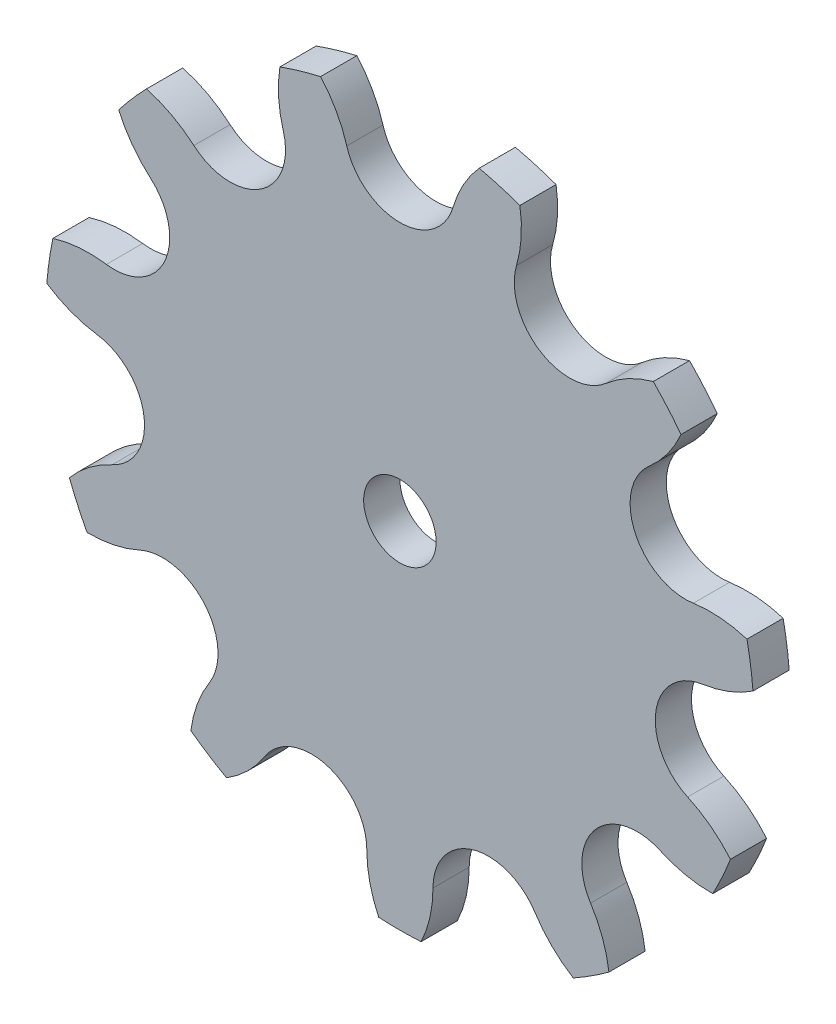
ISO-10303-21;
HEADER;
FILE_DESCRIPTION(('STEP AP214'),'2;1');
FILE_NAME('part.step','',(''),(''),'','','');
FILE_SCHEMA(('AUTOMOTIVE_DESIGN { 1 0 10303 214 1 1 1 1 }'));
ENDSEC;
DATA;
#1=APPLICATION_CONTEXT('core data for automotive mechanical design processes');
#2=APPLICATION_PROTOCOL_DEFINITION('international standard','automotive_design',2000,#1);
#3=PRODUCT_CONTEXT('',#1,'mechanical');
#4=PRODUCT('Part','Part','',(#3));
#5=PRODUCT_RELATED_PRODUCT_CATEGORY('part','',(#4));
#6=PRODUCT_DEFINITION_FORMATION('','',#4);
#7=PRODUCT_DEFINITION_CONTEXT('part definition',#1,'design');
#8=PRODUCT_DEFINITION('design','',#6,#7);
#9=PRODUCT_DEFINITION_SHAPE('','',#8);
#10=(LENGTH_UNIT() NAMED_UNIT(*) SI_UNIT(.MILLI.,.METRE.));
#11=(NAMED_UNIT(*) PLANE_ANGLE_UNIT() SI_UNIT($,.RADIAN.));
#12=(NAMED_UNIT(*) SI_UNIT($,.STERADIAN.) SOLID_ANGLE_UNIT());
#13=UNCERTAINTY_MEASURE_WITH_UNIT(LENGTH_MEASURE(1.E-05),#10,'distance_accuracy_value','');
#14=(GEOMETRIC_REPRESENTATION_CONTEXT(3) GLOBAL_UNCERTAINTY_ASSIGNED_CONTEXT((#13)) GLOBAL_UNIT_ASSIGNED_CONTEXT((#10,
#11,#12)) REPRESENTATION_CONTEXT('',''));
#15=CARTESIAN_POINT('',(0.,0.,0.));
#16=DIRECTION('',(0.,0.,1.));
#17=DIRECTION('',(1.,0.,0.));
#18=AXIS2_PLACEMENT_3D('',#15,#16,#17);
#19=CARTESIAN_POINT('',(0.,0.,2.6));
#20=DIRECTION('',(0.,0.,1.));
#21=DIRECTION('',(1.,0.,0.));
#22=AXIS2_PLACEMENT_3D('',#19,#20,#21);
#23=PLANE('',#22);
#24=CARTESIAN_POINT('',(0.,0.,2.6));
#25=DIRECTION('',(0.,0.,1.));
#26=DIRECTION('',(1.,0.,0.));
#27=AXIS2_PLACEMENT_3D('',#24,#25,#26);
#28=CIRCLE('',#27,2.6);
#29=CARTESIAN_POINT('',(2.6,0.,2.6));
#30=VERTEX_POINT('',#29);
#31=EDGE_CURVE('E549',#30,#30,#28,.T.);
#32=ORIENTED_EDGE('',*,*,#31,.F.);
#33=EDGE_LOOP('',(#32));
#34=FACE_BOUND('',#33,.T.);
#35=CARTESIAN_POINT('',(-17.033919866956,-14.7599755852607,2.6));
#36=DIRECTION('',(0.,0.,1.));
#37=DIRECTION('',(-0.654860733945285,0.755749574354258,0.));
#38=AXIS2_PLACEMENT_3D('',#35,#36,#37);
#39=CIRCLE('',#38,3.975);
#40=CARTESIAN_POINT('',(-13.6899370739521,-16.9090228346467,2.6));
#41=VERTEX_POINT('',#40);
#42=CARTESIAN_POINT('',(-18.6851945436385,-11.1441884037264,2.6));
#43=VERTEX_POINT('',#42);
#44=EDGE_CURVE('E373',#41,#43,#39,.T.);
#45=ORIENTED_EDGE('',*,*,#44,.F.);
#46=CARTESIAN_POINT('',(-6.35000000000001,-21.6261139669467,2.6));
#47=DIRECTION('',(0.,0.,-1.));
#48=DIRECTION('',(-0.654860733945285,0.755749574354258,0.));
#49=AXIS2_PLACEMENT_3D('',#46,#47,#48);
#50=CIRCLE('',#49,8.725);
#51=CARTESIAN_POINT('',(-15.006827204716,-20.537551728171,2.6));
#52=VERTEX_POINT('',#51);
#53=EDGE_CURVE('E371',#52,#41,#50,.T.);
#54=ORIENTED_EDGE('',*,*,#53,.F.);
#55=CARTESIAN_POINT('',(0.,0.,2.6));
#56=DIRECTION('',(0.,0.,1.));
#57=DIRECTION('',(1.,0.,0.));
#58=AXIS2_PLACEMENT_3D('',#55,#56,#57);
#59=CIRCLE('',#58,25.4361139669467);
#60=CARTESIAN_POINT('',(-12.4475528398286,-22.1822974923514,2.6));
#61=VERTEX_POINT('',#60);
#62=EDGE_CURVE('E704',#52,#61,#59,.T.);
#63=ORIENTED_EDGE('',*,*,#62,.T.);
#64=CARTESIAN_POINT('',(-17.033919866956,-14.7599755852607,2.6));
#65=DIRECTION('',(0.,0.,-1.));
#66=DIRECTION('',(-0.959492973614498,0.28173255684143,0.));
#67=AXIS2_PLACEMENT_3D('',#64,#65,#66);
#68=CIRCLE('',#67,8.725);
#69=CARTESIAN_POINT('',(-9.69398279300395,-19.4770667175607,2.6));
#70=VERTEX_POINT('',#69);
#71=EDGE_CURVE('E354',#70,#61,#68,.T.);
#72=ORIENTED_EDGE('',*,*,#71,.F.);
#73=CARTESIAN_POINT('',(-6.35,-21.6261139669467,2.6));
#74=DIRECTION('',(0.,0.,1.));
#75=DIRECTION('',(-0.959492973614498,0.28173255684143,0.));
#76=AXIS2_PLACEMENT_3D('',#73,#74,#75);
#77=CIRCLE('',#76,3.975);
#78=CARTESIAN_POINT('',(-2.375,-21.6261139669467,2.6));
#79=VERTEX_POINT('',#78);
#80=EDGE_CURVE('E351',#79,#70,#77,.T.);
#81=ORIENTED_EDGE('',*,*,#80,.F.);
#82=CARTESIAN_POINT('',(6.35,-21.6261139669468,2.6));
#83=DIRECTION('',(0.,0.,-1.));
#84=DIRECTION('',(-0.959492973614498,0.28173255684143,0.));
#85=AXIS2_PLACEMENT_3D('',#82,#83,#84);
#86=CIRCLE('',#85,8.725);
#87=CARTESIAN_POINT('',(-1.52110764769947,-25.3905912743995,2.6));
#88=VERTEX_POINT('',#87);
#89=EDGE_CURVE('E349',#88,#79,#86,.T.);
#90=ORIENTED_EDGE('',*,*,#89,.F.);
#91=CARTESIAN_POINT('',(1.52110764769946,-25.3905912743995,2.6));
#92=VERTEX_POINT('',#91);
#93=EDGE_CURVE('E707',#88,#92,#59,.T.);
#94=ORIENTED_EDGE('',*,*,#93,.T.);
#95=CARTESIAN_POINT('',(-6.35000000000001,-21.6261139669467,2.6));
#96=DIRECTION('',(0.,0.,-1.));
#97=DIRECTION('',(-0.959492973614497,-0.281732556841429,0.));
#98=AXIS2_PLACEMENT_3D('',#95,#96,#97);
#99=CIRCLE('',#98,8.725);
#100=CARTESIAN_POINT('',(2.375,-21.6261139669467,2.6));
#101=VERTEX_POINT('',#100);
#102=EDGE_CURVE('E495',#101,#92,#99,.T.);
#103=ORIENTED_EDGE('',*,*,#102,.F.);
#104=CARTESIAN_POINT('',(6.34999999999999,-21.6261139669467,2.6));
#105=DIRECTION('',(0.,0.,1.));
#106=DIRECTION('',(-0.959492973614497,-0.281732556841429,0.));
#107=AXIS2_PLACEMENT_3D('',#104,#105,#106);
#108=CIRCLE('',#107,3.975);
#109=CARTESIAN_POINT('',(9.69398279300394,-19.4770667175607,2.6));
#110=VERTEX_POINT('',#109);
#111=EDGE_CURVE('E492',#110,#101,#108,.T.);
#112=ORIENTED_EDGE('',*,*,#111,.F.);
#113=CARTESIAN_POINT('',(17.033919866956,-14.7599755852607,2.6));
#114=DIRECTION('',(0.,0.,-1.));
#115=DIRECTION('',(-0.959492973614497,-0.281732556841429,0.));
#116=AXIS2_PLACEMENT_3D('',#113,#114,#115);
#117=CIRCLE('',#116,8.725);
#118=CARTESIAN_POINT('',(12.4475528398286,-22.1822974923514,2.6));
#119=VERTEX_POINT('',#118);
#120=EDGE_CURVE('E490',#119,#110,#117,.T.);
#121=ORIENTED_EDGE('',*,*,#120,.F.);
#122=CARTESIAN_POINT('',(15.006827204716,-20.537551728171,2.6));
#123=VERTEX_POINT('',#122);
#124=EDGE_CURVE('E712',#119,#123,#59,.T.);
#125=ORIENTED_EDGE('',*,*,#124,.T.);
#126=CARTESIAN_POINT('',(6.35,-21.6261139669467,2.6));
#127=DIRECTION('',(0.,0.,-1.));
#128=DIRECTION('',(-0.654860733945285,-0.755749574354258,0.));
#129=AXIS2_PLACEMENT_3D('',#126,#127,#128);
#130=CIRCLE('',#129,8.725);
#131=CARTESIAN_POINT('',(13.6899370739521,-16.9090228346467,2.6));
#132=VERTEX_POINT('',#131);
#133=EDGE_CURVE('E475',#132,#123,#130,.T.);
#134=ORIENTED_EDGE('',*,*,#133,.F.);
#135=CARTESIAN_POINT('',(17.033919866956,-14.7599755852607,2.6));
#136=DIRECTION('',(0.,0.,1.));
#137=DIRECTION('',(-0.654860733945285,-0.755749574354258,0.));
#138=AXIS2_PLACEMENT_3D('',#135,#136,#137);
#139=CIRCLE('',#138,3.975);
#140=CARTESIAN_POINT('',(18.6851945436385,-11.1441884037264,2.6));
#141=VERTEX_POINT('',#140);
#142=EDGE_CURVE('E472',#141,#132,#139,.T.);
#143=ORIENTED_EDGE('',*,*,#142,.F.);
#144=CARTESIAN_POINT('',(22.30969053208,-3.20764924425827,2.6));
#145=DIRECTION('',(0.,0.,-1.));
#146=DIRECTION('',(-0.654860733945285,-0.755749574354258,0.));
#147=AXIS2_PLACEMENT_3D('',#144,#145,#146);
#148=CIRCLE('',#147,8.725);
#149=CARTESIAN_POINT('',(22.4642032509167,-11.9312809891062,2.6));
#150=VERTEX_POINT('',#149);
#151=EDGE_CURVE('E470',#150,#141,#148,.T.);
#152=ORIENTED_EDGE('',*,*,#151,.F.);
#153=CARTESIAN_POINT('',(23.7279851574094,-9.16398461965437,2.6));
#154=VERTEX_POINT('',#153);
#155=EDGE_CURVE('E717',#150,#154,#59,.T.);
#156=ORIENTED_EDGE('',*,*,#155,.T.);
#157=CARTESIAN_POINT('',(17.033919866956,-14.7599755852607,2.6));
#158=DIRECTION('',(0.,0.,-1.));
#159=DIRECTION('',(-0.142314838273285,-0.989821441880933,0.));
#160=AXIS2_PLACEMENT_3D('',#157,#158,#159);
#161=CIRCLE('',#160,8.725);
#162=CARTESIAN_POINT('',(20.6584158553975,-6.82343642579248,2.6));
#163=VERTEX_POINT('',#162);
#164=EDGE_CURVE('E436',#163,#154,#161,.T.);
#165=ORIENTED_EDGE('',*,*,#164,.F.);
#166=CARTESIAN_POINT('',(22.30969053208,-3.20764924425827,2.6));
#167=DIRECTION('',(0.,0.,1.));
#168=DIRECTION('',(-0.142314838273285,-0.989821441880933,0.));
#169=AXIS2_PLACEMENT_3D('',#166,#167,#168);
#170=CIRCLE('',#169,3.975);
#171=CARTESIAN_POINT('',(21.7439890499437,0.72689098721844,2.6));
#172=VERTEX_POINT('',#171);
#173=EDGE_CURVE('E433',#172,#163,#170,.T.);
#174=ORIENTED_EDGE('',*,*,#173,.F.);
#175=CARTESIAN_POINT('',(20.5022920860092,9.36308306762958,2.6));
#176=DIRECTION('',(0.,0.,-1.));
#177=DIRECTION('',(-0.142314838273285,-0.989821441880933,0.));
#178=AXIS2_PLACEMENT_3D('',#175,#176,#177);
#179=CIRCLE('',#178,8.725);
#180=CARTESIAN_POINT('',(25.3486278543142,2.10783292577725,2.6));
#181=VERTEX_POINT('',#180);
#182=EDGE_CURVE('E431',#181,#172,#179,.T.);
#183=ORIENTED_EDGE('',*,*,#182,.F.);
#184=CARTESIAN_POINT('',(24.915675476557,5.11908285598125,2.6));
#185=VERTEX_POINT('',#184);
#186=EDGE_CURVE('E722',#181,#185,#59,.T.);
#187=ORIENTED_EDGE('',*,*,#186,.T.);
#188=CARTESIAN_POINT('',(22.30969053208,-3.20764924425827,2.6));
#189=DIRECTION('',(0.,0.,-1.));
#190=DIRECTION('',(0.415415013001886,-0.909631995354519,0.));
#191=AXIS2_PLACEMENT_3D('',#188,#189,#190);
#192=CIRCLE('',#191,8.725);
#193=CARTESIAN_POINT('',(21.0679935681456,5.42854283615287,2.6));
#194=VERTEX_POINT('',#193);
#195=EDGE_CURVE('E59',#194,#185,#192,.T.);
#196=ORIENTED_EDGE('',*,*,#195,.F.);
#197=CARTESIAN_POINT('',(20.5022920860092,9.36308306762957,2.6));
#198=DIRECTION('',(0.,0.,1.));
#199=DIRECTION('',(0.415415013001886,-0.909631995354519,0.));
#200=AXIS2_PLACEMENT_3D('',#197,#198,#199);
#201=CIRCLE('',#200,3.975);
#202=CARTESIAN_POINT('',(17.8992206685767,12.3671876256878,2.6));
#203=VERTEX_POINT('',#202);
#204=EDGE_CURVE('E455',#203,#194,#201,.T.);
#205=ORIENTED_EDGE('',*,*,#204,.F.);
#206=CARTESIAN_POINT('',(12.1855607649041,18.9611026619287,2.6));
#207=DIRECTION('',(0.,0.,-1.));
#208=DIRECTION('',(0.415415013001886,-0.909631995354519,0.));
#209=AXIS2_PLACEMENT_3D('',#206,#207,#208);
#210=CIRCLE('',#209,8.725);
#211=CARTESIAN_POINT('',(20.1850422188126,15.4777247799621,2.6));
#212=VERTEX_POINT('',#211);
#213=EDGE_CURVE('E453',#212,#203,#210,.T.);
#214=ORIENTED_EDGE('',*,*,#213,.F.);
#215=CARTESIAN_POINT('',(18.1928148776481,17.7768776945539,2.6));
#216=VERTEX_POINT('',#215);
#217=EDGE_CURVE('E727',#212,#216,#59,.T.);
#218=ORIENTED_EDGE('',*,*,#217,.T.);
#219=CARTESIAN_POINT('',(20.5022920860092,9.36308306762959,2.6));
#220=DIRECTION('',(0.,0.,-1.));
#221=DIRECTION('',(0.841253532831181,-0.540640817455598,0.));
#222=AXIS2_PLACEMENT_3D('',#219,#220,#221);
#223=CIRCLE('',#222,8.725);
#224=CARTESIAN_POINT('',(14.7886321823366,15.9569981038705,2.6));
#225=VERTEX_POINT('',#224);
#226=EDGE_CURVE('E51',#225,#216,#223,.T.);
#227=ORIENTED_EDGE('',*,*,#226,.F.);
#228=CARTESIAN_POINT('',(12.1855607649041,18.9611026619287,2.6));
#229=DIRECTION('',(0.,0.,1.));
#230=DIRECTION('',(0.841253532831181,-0.540640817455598,0.));
#231=AXIS2_PLACEMENT_3D('',#228,#229,#230);
#232=CIRCLE('',#231,3.975);
#233=CARTESIAN_POINT('',(8.37157619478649,20.0809895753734,2.6));
#234=VERTEX_POINT('',#233);
#235=EDGE_CURVE('E328',#234,#225,#232,.T.);
#236=ORIENTED_EDGE('',*,*,#235,.F.);
#237=CARTESIAN_POINT('',(0.,22.5391061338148,2.6));
#238=DIRECTION('',(0.,0.,-1.));
#239=DIRECTION('',(0.841253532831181,-0.540640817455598,0.));
#240=AXIS2_PLACEMENT_3D('',#237,#238,#239);
#241=CIRCLE('',#240,8.725);
#242=CARTESIAN_POINT('',(8.61284829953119,23.9335483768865,2.6));
#243=VERTEX_POINT('',#242);
#244=EDGE_CURVE('E318',#243,#234,#241,.T.);
#245=ORIENTED_EDGE('',*,*,#244,.F.);
#246=CARTESIAN_POINT('',(5.69386409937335,24.7906394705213,2.6));
#247=VERTEX_POINT('',#246);
#248=EDGE_CURVE('E560',#243,#247,#59,.T.);
#249=ORIENTED_EDGE('',*,*,#248,.T.);
#250=CARTESIAN_POINT('',(12.1855607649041,18.9611026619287,2.6));
#251=DIRECTION('',(0.,0.,-1.));
#252=DIRECTION('',(1.,0.,0.));
#253=AXIS2_PLACEMENT_3D('',#250,#251,#252);
#254=CIRCLE('',#253,8.725);
#255=CARTESIAN_POINT('',(3.81398457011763,21.4192192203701,2.6));
#256=VERTEX_POINT('',#255);
#257=EDGE_CURVE('E533',#256,#247,#254,.T.);
#258=ORIENTED_EDGE('',*,*,#257,.F.);
#259=CARTESIAN_POINT('',(0.,22.5391061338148,2.6));
#260=DIRECTION('',(0.,0.,1.));
#261=DIRECTION('',(1.,0.,0.));
#262=AXIS2_PLACEMENT_3D('',#259,#260,#261);
#263=CIRCLE('',#262,3.975);
#264=CARTESIAN_POINT('',(-3.81398457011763,21.4192192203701,2.6));
#265=VERTEX_POINT('',#264);
#266=EDGE_CURVE('E530',#265,#256,#263,.T.);
#267=ORIENTED_EDGE('',*,*,#266,.F.);
#268=CARTESIAN_POINT('',(-12.1855607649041,18.9611026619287,2.6));
#269=DIRECTION('',(0.,0.,-1.));
#270=DIRECTION('',(1.,0.,0.));
#271=AXIS2_PLACEMENT_3D('',#268,#269,#270);
#272=CIRCLE('',#271,8.725);
#273=CARTESIAN_POINT('',(-5.69386409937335,24.7906394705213,2.6));
#274=VERTEX_POINT('',#273);
#275=EDGE_CURVE('E528',#274,#265,#272,.T.);
#276=ORIENTED_EDGE('',*,*,#275,.F.);
#277=CARTESIAN_POINT('',(-8.61284829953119,23.9335483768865,2.6));
#278=VERTEX_POINT('',#277);
#279=EDGE_CURVE('E555',#274,#278,#59,.T.);
#280=ORIENTED_EDGE('',*,*,#279,.T.);
#281=CARTESIAN_POINT('',(0.,22.5391061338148,2.6));
#282=DIRECTION('',(0.,0.,-1.));
#283=DIRECTION('',(0.841253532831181,0.540640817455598,0.));
#284=AXIS2_PLACEMENT_3D('',#281,#282,#283);
#285=CIRCLE('',#284,8.725);
#286=CARTESIAN_POINT('',(-8.37157619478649,20.0809895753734,2.6));
#287=VERTEX_POINT('',#286);
#288=EDGE_CURVE('E513',#287,#278,#285,.T.);
#289=ORIENTED_EDGE('',*,*,#288,.F.);
#290=CARTESIAN_POINT('',(-12.1855607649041,18.9611026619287,2.6));
#291=DIRECTION('',(0.,0.,1.));
#292=DIRECTION('',(0.841253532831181,0.540640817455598,0.));
#293=AXIS2_PLACEMENT_3D('',#290,#291,#292);
#294=CIRCLE('',#293,3.975);
#295=CARTESIAN_POINT('',(-14.7886321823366,15.9569981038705,2.6));
#296=VERTEX_POINT('',#295);
#297=EDGE_CURVE('E510',#296,#287,#294,.T.);
#298=ORIENTED_EDGE('',*,*,#297,.F.);
#299=CARTESIAN_POINT('',(-20.5022920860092,9.36308306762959,2.6));
#300=DIRECTION('',(0.,0.,-1.));
#301=DIRECTION('',(0.841253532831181,0.540640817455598,0.));
#302=AXIS2_PLACEMENT_3D('',#299,#300,#301);
#303=CIRCLE('',#302,8.725);
#304=CARTESIAN_POINT('',(-18.1928148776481,17.7768776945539,2.6));
#305=VERTEX_POINT('',#304);
#306=EDGE_CURVE('E508',#305,#296,#303,.T.);
#307=ORIENTED_EDGE('',*,*,#306,.F.);
#308=CARTESIAN_POINT('',(-20.1850422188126,15.4777247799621,2.6));
#309=VERTEX_POINT('',#308);
#310=EDGE_CURVE('E559',#305,#309,#59,.T.);
#311=ORIENTED_EDGE('',*,*,#310,.T.);
#312=CARTESIAN_POINT('',(-12.1855607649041,18.9611026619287,2.6));
#313=DIRECTION('',(0.,0.,-1.));
#314=DIRECTION('',(0.415415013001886,0.909631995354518,0.));
#315=AXIS2_PLACEMENT_3D('',#312,#313,#314);
#316=CIRCLE('',#315,8.725);
#317=CARTESIAN_POINT('',(-17.8992206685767,12.3671876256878,2.6));
#318=VERTEX_POINT('',#317);
#319=EDGE_CURVE('E396',#318,#309,#316,.T.);
#320=ORIENTED_EDGE('',*,*,#319,.F.);
#321=CARTESIAN_POINT('',(-20.5022920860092,9.36308306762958,2.6));
#322=DIRECTION('',(0.,0.,1.));
#323=DIRECTION('',(0.415415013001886,0.909631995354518,0.));
#324=AXIS2_PLACEMENT_3D('',#321,#322,#323);
#325=CIRCLE('',#324,3.975);
#326=CARTESIAN_POINT('',(-21.0679935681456,5.42854283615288,2.6));
#327=VERTEX_POINT('',#326);
#328=EDGE_CURVE('E393',#327,#318,#325,.T.);
#329=ORIENTED_EDGE('',*,*,#328,.F.);
#330=CARTESIAN_POINT('',(-22.30969053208,-3.20764924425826,2.6));
#331=DIRECTION('',(0.,0.,-1.));
#332=DIRECTION('',(0.415415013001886,0.909631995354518,0.));
#333=AXIS2_PLACEMENT_3D('',#330,#331,#332);
#334=CIRCLE('',#333,8.725);
#335=CARTESIAN_POINT('',(-24.915675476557,5.11908285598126,2.6));
#336=VERTEX_POINT('',#335);
#337=EDGE_CURVE('E391',#336,#327,#334,.T.);
#338=ORIENTED_EDGE('',*,*,#337,.F.);
#339=CARTESIAN_POINT('',(-25.3486278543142,2.10783292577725,2.6));
#340=VERTEX_POINT('',#339);
#341=EDGE_CURVE('E698',#336,#340,#59,.T.);
#342=ORIENTED_EDGE('',*,*,#341,.T.);
#343=CARTESIAN_POINT('',(-20.5022920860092,9.36308306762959,2.6));
#344=DIRECTION('',(0.,0.,-1.));
#345=DIRECTION('',(-0.142314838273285,0.989821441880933,0.));
#346=AXIS2_PLACEMENT_3D('',#343,#344,#345);
#347=CIRCLE('',#346,8.725);
#348=CARTESIAN_POINT('',(-21.7439890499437,0.726890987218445,2.6));
#349=VERTEX_POINT('',#348);
#350=EDGE_CURVE('E418',#349,#340,#347,.T.);
#351=ORIENTED_EDGE('',*,*,#350,.F.);
#352=CARTESIAN_POINT('',(-22.30969053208,-3.20764924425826,2.6));
#353=DIRECTION('',(0.,0.,1.));
#354=DIRECTION('',(-0.142314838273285,0.989821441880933,0.));
#355=AXIS2_PLACEMENT_3D('',#352,#353,#354);
#356=CIRCLE('',#355,3.975);
#357=CARTESIAN_POINT('',(-20.6584158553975,-6.82343642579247,2.6));
#358=VERTEX_POINT('',#357);
#359=EDGE_CURVE('E415',#358,#349,#356,.T.);
#360=ORIENTED_EDGE('',*,*,#359,.F.);
#361=CARTESIAN_POINT('',(-17.033919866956,-14.7599755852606,2.6));
#362=DIRECTION('',(0.,0.,-1.));
#363=DIRECTION('',(-0.142314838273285,0.989821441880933,0.));
#364=AXIS2_PLACEMENT_3D('',#361,#362,#363);
#365=CIRCLE('',#364,8.725);
#366=CARTESIAN_POINT('',(-23.7279851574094,-9.16398461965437,2.6));
#367=VERTEX_POINT('',#366);
#368=EDGE_CURVE('E413',#367,#358,#365,.T.);
#369=ORIENTED_EDGE('',*,*,#368,.F.);
#370=CARTESIAN_POINT('',(-22.4642032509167,-11.9312809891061,2.6));
#371=VERTEX_POINT('',#370);
#372=EDGE_CURVE('E700',#367,#371,#59,.T.);
#373=ORIENTED_EDGE('',*,*,#372,.T.);
#374=CARTESIAN_POINT('',(-22.30969053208,-3.20764924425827,2.6));
#375=DIRECTION('',(0.,0.,-1.));
#376=DIRECTION('',(-0.654860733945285,0.755749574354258,0.));
#377=AXIS2_PLACEMENT_3D('',#374,#375,#376);
#378=CIRCLE('',#377,8.725);
#379=EDGE_CURVE('E376',#43,#371,#378,.T.);
#380=ORIENTED_EDGE('',*,*,#379,.F.);
#381=EDGE_LOOP('',(#45,#54,#63,#72,#81,#90,#94,#103,#112,#121,#125,#134,#143,#152,#156,#165,
#174,#183,#187,#196,#205,#214,#218,#227,#236,#245,#249,#258,#267,#276,#280,#289,#298,#307,#311,
#320,#329,#338,#342,#351,#360,#369,#373,#380));
#382=FACE_BOUND('',#381,.T.);
#383=ADVANCED_FACE('F36',(#34,#382),#23,.T.);
#384=CARTESIAN_POINT('',(0.,0.,0.));
#385=DIRECTION('',(0.,0.,1.));
#386=DIRECTION('',(1.,0.,0.));
#387=AXIS2_PLACEMENT_3D('',#384,#385,#386);
#388=PLANE('',#387);
#389=CARTESIAN_POINT('',(0.,0.,0.));
#390=DIRECTION('',(0.,0.,1.));
#391=DIRECTION('',(1.,0.,0.));
#392=AXIS2_PLACEMENT_3D('',#389,#390,#391);
#393=CIRCLE('',#392,2.6);
#394=CARTESIAN_POINT('',(2.6,0.,0.));
#395=VERTEX_POINT('',#394);
#396=EDGE_CURVE('E548',#395,#395,#393,.T.);
#397=ORIENTED_EDGE('',*,*,#396,.T.);
#398=EDGE_LOOP('',(#397));
#399=FACE_BOUND('',#398,.T.);
#400=CARTESIAN_POINT('',(-6.35000000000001,-21.6261139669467,0.));
#401=DIRECTION('',(0.,0.,-1.));
#402=DIRECTION('',(-0.654860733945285,0.755749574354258,0.));
#403=AXIS2_PLACEMENT_3D('',#400,#401,#402);
#404=CIRCLE('',#403,8.725);
#405=CARTESIAN_POINT('',(-15.006827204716,-20.537551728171,0.));
#406=VERTEX_POINT('',#405);
#407=CARTESIAN_POINT('',(-13.6899370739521,-16.9090228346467,0.));
#408=VERTEX_POINT('',#407);
#409=EDGE_CURVE('E370',#406,#408,#404,.T.);
#410=ORIENTED_EDGE('',*,*,#409,.T.);
#411=CARTESIAN_POINT('',(-17.033919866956,-14.7599755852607,0.));
#412=DIRECTION('',(0.,0.,1.));
#413=DIRECTION('',(-0.654860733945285,0.755749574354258,0.));
#414=AXIS2_PLACEMENT_3D('',#411,#412,#413);
#415=CIRCLE('',#414,3.975);
#416=CARTESIAN_POINT('',(-18.6851945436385,-11.1441884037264,0.));
#417=VERTEX_POINT('',#416);
#418=EDGE_CURVE('E381',#408,#417,#415,.T.);
#419=ORIENTED_EDGE('',*,*,#418,.T.);
#420=CARTESIAN_POINT('',(-22.30969053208,-3.20764924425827,0.));
#421=DIRECTION('',(0.,0.,-1.));
#422=DIRECTION('',(-0.654860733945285,0.755749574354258,0.));
#423=AXIS2_PLACEMENT_3D('',#420,#421,#422);
#424=CIRCLE('',#423,8.725);
#425=CARTESIAN_POINT('',(-22.4642032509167,-11.9312809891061,0.));
#426=VERTEX_POINT('',#425);
#427=EDGE_CURVE('E374',#417,#426,#424,.T.);
#428=ORIENTED_EDGE('',*,*,#427,.T.);
#429=CARTESIAN_POINT('',(0.,0.,0.));
#430=DIRECTION('',(0.,0.,1.));
#431=DIRECTION('',(1.,0.,0.));
#432=AXIS2_PLACEMENT_3D('',#429,#430,#431);
#433=CIRCLE('',#432,25.4361139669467);
#434=CARTESIAN_POINT('',(-23.7279851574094,-9.16398461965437,0.));
#435=VERTEX_POINT('',#434);
#436=EDGE_CURVE('E616',#435,#426,#433,.T.);
#437=ORIENTED_EDGE('',*,*,#436,.F.);
#438=CARTESIAN_POINT('',(-17.033919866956,-14.7599755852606,0.));
#439=DIRECTION('',(0.,0.,-1.));
#440=DIRECTION('',(-0.142314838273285,0.989821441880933,0.));
#441=AXIS2_PLACEMENT_3D('',#438,#439,#440);
#442=CIRCLE('',#441,8.725);
#443=CARTESIAN_POINT('',(-20.6584158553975,-6.82343642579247,0.));
#444=VERTEX_POINT('',#443);
#445=EDGE_CURVE('E390',#435,#444,#442,.T.);
#446=ORIENTED_EDGE('',*,*,#445,.T.);
#447=CARTESIAN_POINT('',(-22.30969053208,-3.20764924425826,0.));
#448=DIRECTION('',(0.,0.,1.));
#449=DIRECTION('',(-0.142314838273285,0.989821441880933,0.));
#450=AXIS2_PLACEMENT_3D('',#447,#448,#449);
#451=CIRCLE('',#450,3.975);
#452=CARTESIAN_POINT('',(-21.7439890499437,0.726890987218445,0.));
#453=VERTEX_POINT('',#452);
#454=EDGE_CURVE('E423',#444,#453,#451,.T.);
#455=ORIENTED_EDGE('',*,*,#454,.T.);
#456=CARTESIAN_POINT('',(-20.5022920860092,9.36308306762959,0.));
#457=DIRECTION('',(0.,0.,-1.));
#458=DIRECTION('',(-0.142314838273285,0.989821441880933,0.));
#459=AXIS2_PLACEMENT_3D('',#456,#457,#458);
#460=CIRCLE('',#459,8.725);
#461=CARTESIAN_POINT('',(-25.3486278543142,2.10783292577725,0.));
#462=VERTEX_POINT('',#461);
#463=EDGE_CURVE('E416',#453,#462,#460,.T.);
#464=ORIENTED_EDGE('',*,*,#463,.T.);
#465=CARTESIAN_POINT('',(-24.915675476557,5.11908285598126,0.));
#466=VERTEX_POINT('',#465);
#467=EDGE_CURVE('E619',#466,#462,#433,.T.);
#468=ORIENTED_EDGE('',*,*,#467,.F.);
#469=CARTESIAN_POINT('',(-22.30969053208,-3.20764924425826,0.));
#470=DIRECTION('',(0.,0.,-1.));
#471=DIRECTION('',(0.415415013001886,0.909631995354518,0.));
#472=AXIS2_PLACEMENT_3D('',#469,#470,#471);
#473=CIRCLE('',#472,8.725);
#474=CARTESIAN_POINT('',(-21.0679935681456,5.42854283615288,0.));
#475=VERTEX_POINT('',#474);
#476=EDGE_CURVE('E399',#466,#475,#473,.T.);
#477=ORIENTED_EDGE('',*,*,#476,.T.);
#478=CARTESIAN_POINT('',(-20.5022920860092,9.36308306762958,0.));
#479=DIRECTION('',(0.,0.,1.));
#480=DIRECTION('',(0.415415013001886,0.909631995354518,0.));
#481=AXIS2_PLACEMENT_3D('',#478,#479,#480);
#482=CIRCLE('',#481,3.975);
#483=CARTESIAN_POINT('',(-17.8992206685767,12.3671876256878,0.));
#484=VERTEX_POINT('',#483);
#485=EDGE_CURVE('E402',#475,#484,#482,.T.);
#486=ORIENTED_EDGE('',*,*,#485,.T.);
#487=CARTESIAN_POINT('',(-12.1855607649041,18.9611026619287,0.));
#488=DIRECTION('',(0.,0.,-1.));
#489=DIRECTION('',(0.415415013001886,0.909631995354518,0.));
#490=AXIS2_PLACEMENT_3D('',#487,#488,#489);
#491=CIRCLE('',#490,8.725);
#492=CARTESIAN_POINT('',(-20.1850422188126,15.4777247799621,0.));
#493=VERTEX_POINT('',#492);
#494=EDGE_CURVE('E394',#484,#493,#491,.T.);
#495=ORIENTED_EDGE('',*,*,#494,.T.);
#496=CARTESIAN_POINT('',(-18.1928148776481,17.7768776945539,0.));
#497=VERTEX_POINT('',#496);
#498=EDGE_CURVE('E564',#497,#493,#433,.T.);
#499=ORIENTED_EDGE('',*,*,#498,.F.);
#500=CARTESIAN_POINT('',(-20.5022920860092,9.36308306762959,0.));
#501=DIRECTION('',(0.,0.,-1.));
#502=DIRECTION('',(0.841253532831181,0.540640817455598,0.));
#503=AXIS2_PLACEMENT_3D('',#500,#501,#502);
#504=CIRCLE('',#503,8.725);
#505=CARTESIAN_POINT('',(-14.7886321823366,15.9569981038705,0.));
#506=VERTEX_POINT('',#505);
#507=EDGE_CURVE('E412',#497,#506,#504,.T.);
#508=ORIENTED_EDGE('',*,*,#507,.T.);
#509=CARTESIAN_POINT('',(-12.1855607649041,18.9611026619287,0.));
#510=DIRECTION('',(0.,0.,1.));
#511=DIRECTION('',(0.841253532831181,0.540640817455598,0.));
#512=AXIS2_PLACEMENT_3D('',#509,#510,#511);
#513=CIRCLE('',#512,3.975);
#514=CARTESIAN_POINT('',(-8.37157619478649,20.0809895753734,0.));
#515=VERTEX_POINT('',#514);
#516=EDGE_CURVE('E518',#506,#515,#513,.T.);
#517=ORIENTED_EDGE('',*,*,#516,.T.);
#518=CARTESIAN_POINT('',(0.,22.5391061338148,0.));
#519=DIRECTION('',(0.,0.,-1.));
#520=DIRECTION('',(0.841253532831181,0.540640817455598,0.));
#521=AXIS2_PLACEMENT_3D('',#518,#519,#520);
#522=CIRCLE('',#521,8.725);
#523=CARTESIAN_POINT('',(-8.61284829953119,23.9335483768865,0.));
#524=VERTEX_POINT('',#523);
#525=EDGE_CURVE('E511',#515,#524,#522,.T.);
#526=ORIENTED_EDGE('',*,*,#525,.T.);
#527=CARTESIAN_POINT('',(-5.69386409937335,24.7906394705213,0.));
#528=VERTEX_POINT('',#527);
#529=EDGE_CURVE('E561',#528,#524,#433,.T.);
#530=ORIENTED_EDGE('',*,*,#529,.F.);
#531=CARTESIAN_POINT('',(-12.1855607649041,18.9611026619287,0.));
#532=DIRECTION('',(0.,0.,-1.));
#533=DIRECTION('',(1.,0.,0.));
#534=AXIS2_PLACEMENT_3D('',#531,#532,#533);
#535=CIRCLE('',#534,8.725);
#536=CARTESIAN_POINT('',(-3.81398457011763,21.4192192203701,0.));
#537=VERTEX_POINT('',#536);
#538=EDGE_CURVE('E527',#528,#537,#535,.T.);
#539=ORIENTED_EDGE('',*,*,#538,.T.);
#540=CARTESIAN_POINT('',(0.,22.5391061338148,0.));
#541=DIRECTION('',(0.,0.,1.));
#542=DIRECTION('',(1.,0.,0.));
#543=AXIS2_PLACEMENT_3D('',#540,#541,#542);
#544=CIRCLE('',#543,3.975);
#545=CARTESIAN_POINT('',(3.81398457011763,21.4192192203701,0.));
#546=VERTEX_POINT('',#545);
#547=EDGE_CURVE('E539',#537,#546,#544,.T.);
#548=ORIENTED_EDGE('',*,*,#547,.T.);
#549=CARTESIAN_POINT('',(12.1855607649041,18.9611026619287,0.));
#550=DIRECTION('',(0.,0.,-1.));
#551=DIRECTION('',(1.,0.,0.));
#552=AXIS2_PLACEMENT_3D('',#549,#550,#551);
#553=CIRCLE('',#552,8.725);
#554=CARTESIAN_POINT('',(5.69386409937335,24.7906394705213,0.));
#555=VERTEX_POINT('',#554);
#556=EDGE_CURVE('E531',#546,#555,#553,.T.);
#557=ORIENTED_EDGE('',*,*,#556,.T.);
#558=CARTESIAN_POINT('',(8.61284829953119,23.9335483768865,0.));
#559=VERTEX_POINT('',#558);
#560=EDGE_CURVE('E552',#559,#555,#433,.T.);
#561=ORIENTED_EDGE('',*,*,#560,.F.);
#562=CARTESIAN_POINT('',(0.,22.5391061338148,0.));
#563=DIRECTION('',(0.,0.,-1.));
#564=DIRECTION('',(0.841253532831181,-0.540640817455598,0.));
#565=AXIS2_PLACEMENT_3D('',#562,#563,#564);
#566=CIRCLE('',#565,8.725);
#567=CARTESIAN_POINT('',(8.37157619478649,20.0809895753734,0.));
#568=VERTEX_POINT('',#567);
#569=EDGE_CURVE('E343',#559,#568,#566,.T.);
#570=ORIENTED_EDGE('',*,*,#569,.T.);
#571=CARTESIAN_POINT('',(12.1855607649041,18.9611026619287,0.));
#572=DIRECTION('',(0.,0.,1.));
#573=DIRECTION('',(0.841253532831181,-0.540640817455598,0.));
#574=AXIS2_PLACEMENT_3D('',#571,#572,#573);
#575=CIRCLE('',#574,3.975);
#576=CARTESIAN_POINT('',(14.7886321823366,15.9569981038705,0.));
#577=VERTEX_POINT('',#576);
#578=EDGE_CURVE('E334',#568,#577,#575,.T.);
#579=ORIENTED_EDGE('',*,*,#578,.T.);
#580=CARTESIAN_POINT('',(20.5022920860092,9.36308306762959,0.));
#581=DIRECTION('',(0.,0.,-1.));
#582=DIRECTION('',(0.841253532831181,-0.540640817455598,0.));
#583=AXIS2_PLACEMENT_3D('',#580,#581,#582);
#584=CIRCLE('',#583,8.725);
#585=CARTESIAN_POINT('',(18.1928148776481,17.7768776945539,0.));
#586=VERTEX_POINT('',#585);
#587=EDGE_CURVE('E329',#577,#586,#584,.T.);
#588=ORIENTED_EDGE('',*,*,#587,.T.);
#589=CARTESIAN_POINT('',(20.1850422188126,15.4777247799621,0.));
#590=VERTEX_POINT('',#589);
#591=EDGE_CURVE('E647',#590,#586,#433,.T.);
#592=ORIENTED_EDGE('',*,*,#591,.F.);
#593=CARTESIAN_POINT('',(12.1855607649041,18.9611026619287,0.));
#594=DIRECTION('',(0.,0.,-1.));
#595=DIRECTION('',(0.415415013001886,-0.909631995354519,0.));
#596=AXIS2_PLACEMENT_3D('',#593,#594,#595);
#597=CIRCLE('',#596,8.725);
#598=CARTESIAN_POINT('',(17.8992206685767,12.3671876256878,0.));
#599=VERTEX_POINT('',#598);
#600=EDGE_CURVE('E335',#590,#599,#597,.T.);
#601=ORIENTED_EDGE('',*,*,#600,.T.);
#602=CARTESIAN_POINT('',(20.5022920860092,9.36308306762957,0.));
#603=DIRECTION('',(0.,0.,1.));
#604=DIRECTION('',(0.415415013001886,-0.909631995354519,0.));
#605=AXIS2_PLACEMENT_3D('',#602,#603,#604);
#606=CIRCLE('',#605,3.975);
#607=CARTESIAN_POINT('',(21.0679935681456,5.42854283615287,0.));
#608=VERTEX_POINT('',#607);
#609=EDGE_CURVE('E462',#599,#608,#606,.T.);
#610=ORIENTED_EDGE('',*,*,#609,.T.);
#611=CARTESIAN_POINT('',(22.30969053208,-3.20764924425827,0.));
#612=DIRECTION('',(0.,0.,-1.));
#613=DIRECTION('',(0.415415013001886,-0.909631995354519,0.));
#614=AXIS2_PLACEMENT_3D('',#611,#612,#613);
#615=CIRCLE('',#614,8.725);
#616=CARTESIAN_POINT('',(24.915675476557,5.11908285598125,0.));
#617=VERTEX_POINT('',#616);
#618=EDGE_CURVE('E456',#608,#617,#615,.T.);
#619=ORIENTED_EDGE('',*,*,#618,.T.);
#620=CARTESIAN_POINT('',(25.3486278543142,2.10783292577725,0.));
#621=VERTEX_POINT('',#620);
#622=EDGE_CURVE('E641',#621,#617,#433,.T.);
#623=ORIENTED_EDGE('',*,*,#622,.F.);
#624=CARTESIAN_POINT('',(20.5022920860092,9.36308306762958,0.));
#625=DIRECTION('',(0.,0.,-1.));
#626=DIRECTION('',(-0.142314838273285,-0.989821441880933,0.));
#627=AXIS2_PLACEMENT_3D('',#624,#625,#626);
#628=CIRCLE('',#627,8.725);
#629=CARTESIAN_POINT('',(21.7439890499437,0.72689098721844,0.));
#630=VERTEX_POINT('',#629);
#631=EDGE_CURVE('E439',#621,#630,#628,.T.);
#632=ORIENTED_EDGE('',*,*,#631,.T.);
#633=CARTESIAN_POINT('',(22.30969053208,-3.20764924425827,0.));
#634=DIRECTION('',(0.,0.,1.));
#635=DIRECTION('',(-0.142314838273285,-0.989821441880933,0.));
#636=AXIS2_PLACEMENT_3D('',#633,#634,#635);
#637=CIRCLE('',#636,3.975);
#638=CARTESIAN_POINT('',(20.6584158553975,-6.82343642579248,0.));
#639=VERTEX_POINT('',#638);
#640=EDGE_CURVE('E442',#630,#639,#637,.T.);
#641=ORIENTED_EDGE('',*,*,#640,.T.);
#642=CARTESIAN_POINT('',(17.033919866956,-14.7599755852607,0.));
#643=DIRECTION('',(0.,0.,-1.));
#644=DIRECTION('',(-0.142314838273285,-0.989821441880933,0.));
#645=AXIS2_PLACEMENT_3D('',#642,#643,#644);
#646=CIRCLE('',#645,8.725);
#647=CARTESIAN_POINT('',(23.7279851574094,-9.16398461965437,0.));
#648=VERTEX_POINT('',#647);
#649=EDGE_CURVE('E434',#639,#648,#646,.T.);
#650=ORIENTED_EDGE('',*,*,#649,.T.);
#651=CARTESIAN_POINT('',(22.4642032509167,-11.9312809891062,0.));
#652=VERTEX_POINT('',#651);
#653=EDGE_CURVE('E635',#652,#648,#433,.T.);
#654=ORIENTED_EDGE('',*,*,#653,.F.);
#655=CARTESIAN_POINT('',(22.30969053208,-3.20764924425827,0.));
#656=DIRECTION('',(0.,0.,-1.));
#657=DIRECTION('',(-0.654860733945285,-0.755749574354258,0.));
#658=AXIS2_PLACEMENT_3D('',#655,#656,#657);
#659=CIRCLE('',#658,8.725);
#660=CARTESIAN_POINT('',(18.6851945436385,-11.1441884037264,0.));
#661=VERTEX_POINT('',#660);
#662=EDGE_CURVE('E452',#652,#661,#659,.T.);
#663=ORIENTED_EDGE('',*,*,#662,.T.);
#664=CARTESIAN_POINT('',(17.033919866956,-14.7599755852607,0.));
#665=DIRECTION('',(0.,0.,1.));
#666=DIRECTION('',(-0.654860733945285,-0.755749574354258,0.));
#667=AXIS2_PLACEMENT_3D('',#664,#665,#666);
#668=CIRCLE('',#667,3.975);
#669=CARTESIAN_POINT('',(13.6899370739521,-16.9090228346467,0.));
#670=VERTEX_POINT('',#669);
#671=EDGE_CURVE('E480',#661,#670,#668,.T.);
#672=ORIENTED_EDGE('',*,*,#671,.T.);
#673=CARTESIAN_POINT('',(6.35,-21.6261139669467,0.));
#674=DIRECTION('',(0.,0.,-1.));
#675=DIRECTION('',(-0.654860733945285,-0.755749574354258,0.));
#676=AXIS2_PLACEMENT_3D('',#673,#674,#675);
#677=CIRCLE('',#676,8.725);
#678=CARTESIAN_POINT('',(15.006827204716,-20.537551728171,0.));
#679=VERTEX_POINT('',#678);
#680=EDGE_CURVE('E473',#670,#679,#677,.T.);
#681=ORIENTED_EDGE('',*,*,#680,.T.);
#682=CARTESIAN_POINT('',(12.4475528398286,-22.1822974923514,0.));
#683=VERTEX_POINT('',#682);
#684=EDGE_CURVE('E629',#683,#679,#433,.T.);
#685=ORIENTED_EDGE('',*,*,#684,.F.);
#686=CARTESIAN_POINT('',(17.033919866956,-14.7599755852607,0.));
#687=DIRECTION('',(0.,0.,-1.));
#688=DIRECTION('',(-0.959492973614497,-0.281732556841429,0.));
#689=AXIS2_PLACEMENT_3D('',#686,#687,#688);
#690=CIRCLE('',#689,8.725);
#691=CARTESIAN_POINT('',(9.69398279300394,-19.4770667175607,0.));
#692=VERTEX_POINT('',#691);
#693=EDGE_CURVE('E489',#683,#692,#690,.T.);
#694=ORIENTED_EDGE('',*,*,#693,.T.);
#695=CARTESIAN_POINT('',(6.34999999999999,-21.6261139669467,0.));
#696=DIRECTION('',(0.,0.,1.));
#697=DIRECTION('',(-0.959492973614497,-0.281732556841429,0.));
#698=AXIS2_PLACEMENT_3D('',#695,#696,#697);
#699=CIRCLE('',#698,3.975);
#700=CARTESIAN_POINT('',(2.375,-21.6261139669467,0.));
#701=VERTEX_POINT('',#700);
#702=EDGE_CURVE('E500',#692,#701,#699,.T.);
#703=ORIENTED_EDGE('',*,*,#702,.T.);
#704=CARTESIAN_POINT('',(-6.35000000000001,-21.6261139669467,0.));
#705=DIRECTION('',(0.,0.,-1.));
#706=DIRECTION('',(-0.959492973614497,-0.281732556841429,0.));
#707=AXIS2_PLACEMENT_3D('',#704,#705,#706);
#708=CIRCLE('',#707,8.725);
#709=CARTESIAN_POINT('',(1.52110764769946,-25.3905912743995,0.));
#710=VERTEX_POINT('',#709);
#711=EDGE_CURVE('E493',#701,#710,#708,.T.);
#712=ORIENTED_EDGE('',*,*,#711,.T.);
#713=CARTESIAN_POINT('',(-1.52110764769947,-25.3905912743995,0.));
#714=VERTEX_POINT('',#713);
#715=EDGE_CURVE('E623',#714,#710,#433,.T.);
#716=ORIENTED_EDGE('',*,*,#715,.F.);
#717=CARTESIAN_POINT('',(6.35,-21.6261139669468,0.));
#718=DIRECTION('',(0.,0.,-1.));
#719=DIRECTION('',(-0.959492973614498,0.28173255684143,0.));
#720=AXIS2_PLACEMENT_3D('',#717,#718,#719);
#721=CIRCLE('',#720,8.725);
#722=CARTESIAN_POINT('',(-2.375,-21.6261139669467,0.));
#723=VERTEX_POINT('',#722);
#724=EDGE_CURVE('E357',#714,#723,#721,.T.);
#725=ORIENTED_EDGE('',*,*,#724,.T.);
#726=CARTESIAN_POINT('',(-6.35,-21.6261139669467,0.));
#727=DIRECTION('',(0.,0.,1.));
#728=DIRECTION('',(-0.959492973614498,0.28173255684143,0.));
#729=AXIS2_PLACEMENT_3D('',#726,#727,#728);
#730=CIRCLE('',#729,3.975);
#731=CARTESIAN_POINT('',(-9.69398279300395,-19.4770667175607,0.));
#732=VERTEX_POINT('',#731);
#733=EDGE_CURVE('E360',#723,#732,#730,.T.);
#734=ORIENTED_EDGE('',*,*,#733,.T.);
#735=CARTESIAN_POINT('',(-17.033919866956,-14.7599755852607,0.));
#736=DIRECTION('',(0.,0.,-1.));
#737=DIRECTION('',(-0.959492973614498,0.28173255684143,0.));
#738=AXIS2_PLACEMENT_3D('',#735,#736,#737);
#739=CIRCLE('',#738,8.725);
#740=CARTESIAN_POINT('',(-12.4475528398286,-22.1822974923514,0.));
#741=VERTEX_POINT('',#740);
#742=EDGE_CURVE('E352',#732,#741,#739,.T.);
#743=ORIENTED_EDGE('',*,*,#742,.T.);
#744=EDGE_CURVE('E620',#406,#741,#433,.T.);
#745=ORIENTED_EDGE('',*,*,#744,.F.);
#746=EDGE_LOOP('',(#410,#419,#428,#437,#446,#455,#464,#468,#477,#486,#495,#499,#508,#517,#526,
#530,#539,#548,#557,#561,#570,#579,#588,#592,#601,#610,#619,#623,#632,#641,#650,#654,#663,#672,
#681,#685,#694,#703,#712,#716,#725,#734,#743,#745));
#747=FACE_BOUND('',#746,.T.);
#748=ADVANCED_FACE('F615',(#399,#747),#388,.F.);
#749=CARTESIAN_POINT('',(0.,0.,2.6));
#750=DIRECTION('',(0.,0.,-1.));
#751=DIRECTION('',(-1.,0.,0.));
#752=AXIS2_PLACEMENT_3D('',#749,#750,#751);
#753=CYLINDRICAL_SURFACE('',#752,25.4361139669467);
#754=DIRECTION('',(0.,0.,-1.));
#755=VECTOR('',#754,1.);
#756=CARTESIAN_POINT('',(-15.006827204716,-20.537551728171,1.3));
#757=LINE('',#756,#755);
#758=EDGE_CURVE('E11',#406,#52,#757,.F.);
#759=ORIENTED_EDGE('',*,*,#758,.F.);
#760=ORIENTED_EDGE('',*,*,#744,.T.);
#761=DIRECTION('',(0.,0.,-1.));
#762=VECTOR('',#761,1.);
#763=CARTESIAN_POINT('',(-12.4475528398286,-22.1822974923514,1.3));
#764=LINE('',#763,#762);
#765=EDGE_CURVE('E600',#61,#741,#764,.T.);
#766=ORIENTED_EDGE('',*,*,#765,.F.);
#767=ORIENTED_EDGE('',*,*,#62,.F.);
#768=EDGE_LOOP('',(#759,#760,#766,#767));
#769=FACE_BOUND('',#768,.T.);
#770=ADVANCED_FACE('F38',(#769),#753,.T.);
#771=DIRECTION('',(0.,0.,-1.));
#772=VECTOR('',#771,1.);
#773=CARTESIAN_POINT('',(-22.4642032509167,-11.9312809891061,1.3));
#774=LINE('',#773,#772);
#775=EDGE_CURVE('E44',#371,#426,#774,.T.);
#776=ORIENTED_EDGE('',*,*,#775,.F.);
#777=ORIENTED_EDGE('',*,*,#372,.F.);
#778=DIRECTION('',(0.,0.,-1.));
#779=VECTOR('',#778,1.);
#780=CARTESIAN_POINT('',(-23.7279851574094,-9.16398461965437,1.3));
#781=LINE('',#780,#779);
#782=EDGE_CURVE('E598',#435,#367,#781,.F.);
#783=ORIENTED_EDGE('',*,*,#782,.F.);
#784=ORIENTED_EDGE('',*,*,#436,.T.);
#785=EDGE_LOOP('',(#776,#777,#783,#784));
#786=FACE_BOUND('',#785,.T.);
#787=ADVANCED_FACE('F618',(#786),#753,.T.);
#788=DIRECTION('',(0.,0.,-1.));
#789=VECTOR('',#788,1.);
#790=CARTESIAN_POINT('',(-1.52110764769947,-25.3905912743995,1.3));
#791=LINE('',#790,#789);
#792=EDGE_CURVE('E602',#714,#88,#791,.F.);
#793=ORIENTED_EDGE('',*,*,#792,.F.);
#794=ORIENTED_EDGE('',*,*,#715,.T.);
#795=DIRECTION('',(0.,0.,-1.));
#796=VECTOR('',#795,1.);
#797=CARTESIAN_POINT('',(1.52110764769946,-25.3905912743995,1.3));
#798=LINE('',#797,#796);
#799=EDGE_CURVE('E580',#92,#710,#798,.T.);
#800=ORIENTED_EDGE('',*,*,#799,.F.);
#801=ORIENTED_EDGE('',*,*,#93,.F.);
#802=EDGE_LOOP('',(#793,#794,#800,#801));
#803=FACE_BOUND('',#802,.T.);
#804=ADVANCED_FACE('F1070',(#803),#753,.T.);
#805=DIRECTION('',(0.,0.,-1.));
#806=VECTOR('',#805,1.);
#807=CARTESIAN_POINT('',(-25.3486278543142,2.10783292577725,1.3));
#808=LINE('',#807,#806);
#809=EDGE_CURVE('E596',#340,#462,#808,.T.);
#810=ORIENTED_EDGE('',*,*,#809,.F.);
#811=ORIENTED_EDGE('',*,*,#341,.F.);
#812=DIRECTION('',(0.,0.,-1.));
#813=VECTOR('',#812,1.);
#814=CARTESIAN_POINT('',(-24.915675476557,5.11908285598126,1.3));
#815=LINE('',#814,#813);
#816=EDGE_CURVE('E594',#466,#336,#815,.F.);
#817=ORIENTED_EDGE('',*,*,#816,.F.);
#818=ORIENTED_EDGE('',*,*,#467,.T.);
#819=EDGE_LOOP('',(#810,#811,#817,#818));
#820=FACE_BOUND('',#819,.T.);
#821=ADVANCED_FACE('F1077',(#820),#753,.T.);
#822=DIRECTION('',(0.,0.,-1.));
#823=VECTOR('',#822,1.);
#824=CARTESIAN_POINT('',(-20.1850422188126,15.4777247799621,1.3));
#825=LINE('',#824,#823);
#826=EDGE_CURVE('E592',#309,#493,#825,.T.);
#827=ORIENTED_EDGE('',*,*,#826,.F.);
#828=ORIENTED_EDGE('',*,*,#310,.F.);
#829=DIRECTION('',(0.,0.,-1.));
#830=VECTOR('',#829,1.);
#831=CARTESIAN_POINT('',(-18.1928148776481,17.7768776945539,1.3));
#832=LINE('',#831,#830);
#833=EDGE_CURVE('E571',#497,#305,#832,.F.);
#834=ORIENTED_EDGE('',*,*,#833,.F.);
#835=ORIENTED_EDGE('',*,*,#498,.T.);
#836=EDGE_LOOP('',(#827,#828,#834,#835));
#837=FACE_BOUND('',#836,.T.);
#838=ADVANCED_FACE('F696',(#837),#753,.T.);
#839=DIRECTION('',(0.,0.,-1.));
#840=VECTOR('',#839,1.);
#841=CARTESIAN_POINT('',(20.1850422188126,15.4777247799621,1.3));
#842=LINE('',#841,#840);
#843=EDGE_CURVE('E590',#590,#212,#842,.F.);
#844=ORIENTED_EDGE('',*,*,#843,.F.);
#845=ORIENTED_EDGE('',*,*,#591,.T.);
#846=DIRECTION('',(0.,0.,-1.));
#847=VECTOR('',#846,1.);
#848=CARTESIAN_POINT('',(18.1928148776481,17.7768776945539,1.3));
#849=LINE('',#848,#847);
#850=EDGE_CURVE('E573',#216,#586,#849,.T.);
#851=ORIENTED_EDGE('',*,*,#850,.F.);
#852=ORIENTED_EDGE('',*,*,#217,.F.);
#853=EDGE_LOOP('',(#844,#845,#851,#852));
#854=FACE_BOUND('',#853,.T.);
#855=ADVANCED_FACE('F733',(#854),#753,.T.);
#856=DIRECTION('',(0.,0.,-1.));
#857=VECTOR('',#856,1.);
#858=CARTESIAN_POINT('',(24.915675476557,5.11908285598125,1.3));
#859=LINE('',#858,#857);
#860=EDGE_CURVE('E588',#185,#617,#859,.T.);
#861=ORIENTED_EDGE('',*,*,#860,.F.);
#862=ORIENTED_EDGE('',*,*,#186,.F.);
#863=DIRECTION('',(0.,0.,-1.));
#864=VECTOR('',#863,1.);
#865=CARTESIAN_POINT('',(25.3486278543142,2.10783292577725,1.3));
#866=LINE('',#865,#864);
#867=EDGE_CURVE('E586',#621,#181,#866,.F.);
#868=ORIENTED_EDGE('',*,*,#867,.F.);
#869=ORIENTED_EDGE('',*,*,#622,.T.);
#870=EDGE_LOOP('',(#861,#862,#868,#869));
#871=FACE_BOUND('',#870,.T.);
#872=ADVANCED_FACE('F746',(#871),#753,.T.);
#873=DIRECTION('',(0.,0.,-1.));
#874=VECTOR('',#873,1.);
#875=CARTESIAN_POINT('',(23.7279851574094,-9.16398461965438,1.3));
#876=LINE('',#875,#874);
#877=EDGE_CURVE('E584',#154,#648,#876,.T.);
#878=ORIENTED_EDGE('',*,*,#877,.F.);
#879=ORIENTED_EDGE('',*,*,#155,.F.);
#880=DIRECTION('',(0.,0.,-1.));
#881=VECTOR('',#880,1.);
#882=CARTESIAN_POINT('',(22.4642032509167,-11.9312809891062,1.3));
#883=LINE('',#882,#881);
#884=EDGE_CURVE('E578',#652,#150,#883,.F.);
#885=ORIENTED_EDGE('',*,*,#884,.F.);
#886=ORIENTED_EDGE('',*,*,#653,.T.);
#887=EDGE_LOOP('',(#878,#879,#885,#886));
#888=FACE_BOUND('',#887,.T.);
#889=ADVANCED_FACE('F748',(#888),#753,.T.);
#890=DIRECTION('',(0.,0.,-1.));
#891=VECTOR('',#890,1.);
#892=CARTESIAN_POINT('',(12.4475528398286,-22.1822974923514,1.3));
#893=LINE('',#892,#891);
#894=EDGE_CURVE('E582',#683,#119,#893,.F.);
#895=ORIENTED_EDGE('',*,*,#894,.F.);
#896=ORIENTED_EDGE('',*,*,#684,.T.);
#897=DIRECTION('',(0.,0.,-1.));
#898=VECTOR('',#897,1.);
#899=CARTESIAN_POINT('',(15.006827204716,-20.537551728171,1.3));
#900=LINE('',#899,#898);
#901=EDGE_CURVE('E576',#123,#679,#900,.T.);
#902=ORIENTED_EDGE('',*,*,#901,.F.);
#903=ORIENTED_EDGE('',*,*,#124,.F.);
#904=EDGE_LOOP('',(#895,#896,#902,#903));
#905=FACE_BOUND('',#904,.T.);
#906=ADVANCED_FACE('F753',(#905),#753,.T.);
#907=DIRECTION('',(0.,0.,-1.));
#908=VECTOR('',#907,1.);
#909=CARTESIAN_POINT('',(8.61284829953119,23.9335483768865,1.3));
#910=LINE('',#909,#908);
#911=EDGE_CURVE('E324',#559,#243,#910,.F.);
#912=ORIENTED_EDGE('',*,*,#911,.F.);
#913=ORIENTED_EDGE('',*,*,#560,.T.);
#914=DIRECTION('',(0.,0.,-1.));
#915=VECTOR('',#914,1.);
#916=CARTESIAN_POINT('',(5.69386409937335,24.7906394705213,1.3));
#917=LINE('',#916,#915);
#918=EDGE_CURVE('E558',#247,#555,#917,.T.);
#919=ORIENTED_EDGE('',*,*,#918,.F.);
#920=ORIENTED_EDGE('',*,*,#248,.F.);
#921=EDGE_LOOP('',(#912,#913,#919,#920));
#922=FACE_BOUND('',#921,.T.);
#923=ADVANCED_FACE('F658',(#922),#753,.T.);
#924=DIRECTION('',(0.,0.,-1.));
#925=VECTOR('',#924,1.);
#926=CARTESIAN_POINT('',(-8.61284829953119,23.9335483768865,1.3));
#927=LINE('',#926,#925);
#928=EDGE_CURVE('E569',#278,#524,#927,.T.);
#929=ORIENTED_EDGE('',*,*,#928,.F.);
#930=ORIENTED_EDGE('',*,*,#279,.F.);
#931=DIRECTION('',(0.,0.,-1.));
#932=VECTOR('',#931,1.);
#933=CARTESIAN_POINT('',(-5.69386409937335,24.7906394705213,1.3));
#934=LINE('',#933,#932);
#935=EDGE_CURVE('E567',#528,#274,#934,.F.);
#936=ORIENTED_EDGE('',*,*,#935,.F.);
#937=ORIENTED_EDGE('',*,*,#529,.T.);
#938=EDGE_LOOP('',(#929,#930,#936,#937));
#939=FACE_BOUND('',#938,.T.);
#940=ADVANCED_FACE('F677',(#939),#753,.T.);
#941=CARTESIAN_POINT('',(0.,0.,2.6));
#942=DIRECTION('',(0.,0.,-1.));
#943=DIRECTION('',(-1.,0.,0.));
#944=AXIS2_PLACEMENT_3D('',#941,#942,#943);
#945=CYLINDRICAL_SURFACE('',#944,2.6);
#946=ORIENTED_EDGE('',*,*,#31,.T.);
#947=EDGE_LOOP('',(#946));
#948=FACE_BOUND('',#947,.T.);
#949=ORIENTED_EDGE('',*,*,#396,.F.);
#950=EDGE_LOOP('',(#949));
#951=FACE_BOUND('',#950,.T.);
#952=ADVANCED_FACE('F763',(#948,#951),#945,.F.);
#953=CARTESIAN_POINT('',(-12.1855607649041,18.9611026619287,2.6));
#954=DIRECTION('',(0.,0.,-1.));
#955=DIRECTION('',(-1.,0.,0.));
#956=AXIS2_PLACEMENT_3D('',#953,#954,#955);
#957=CYLINDRICAL_SURFACE('',#956,8.725);
#958=ORIENTED_EDGE('',*,*,#935,.T.);
#959=ORIENTED_EDGE('',*,*,#275,.T.);
#960=DIRECTION('',(0.,0.,-1.));
#961=VECTOR('',#960,1.);
#962=CARTESIAN_POINT('',(-3.81398457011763,21.4192192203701,2.6));
#963=LINE('',#962,#961);
#964=EDGE_CURVE('E545',#265,#537,#963,.T.);
#965=ORIENTED_EDGE('',*,*,#964,.T.);
#966=ORIENTED_EDGE('',*,*,#538,.F.);
#967=EDGE_LOOP('',(#958,#959,#965,#966));
#968=FACE_BOUND('',#967,.T.);
#969=ADVANCED_FACE('F670',(#968),#957,.T.);
#970=CARTESIAN_POINT('',(12.1855607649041,18.9611026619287,2.6));
#971=DIRECTION('',(0.,0.,-1.));
#972=DIRECTION('',(-1.,0.,0.));
#973=AXIS2_PLACEMENT_3D('',#970,#971,#972);
#974=CYLINDRICAL_SURFACE('',#973,8.725);
#975=ORIENTED_EDGE('',*,*,#918,.T.);
#976=ORIENTED_EDGE('',*,*,#556,.F.);
#977=DIRECTION('',(0.,0.,-1.));
#978=VECTOR('',#977,1.);
#979=CARTESIAN_POINT('',(3.81398457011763,21.4192192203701,2.6));
#980=LINE('',#979,#978);
#981=EDGE_CURVE('E536',#256,#546,#980,.T.);
#982=ORIENTED_EDGE('',*,*,#981,.F.);
#983=ORIENTED_EDGE('',*,*,#257,.T.);
#984=EDGE_LOOP('',(#975,#976,#982,#983));
#985=FACE_BOUND('',#984,.T.);
#986=ADVANCED_FACE('F661',(#985),#974,.T.);
#987=CARTESIAN_POINT('',(0.,22.5391061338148,2.6));
#988=DIRECTION('',(0.,0.,-1.));
#989=DIRECTION('',(-1.,0.,0.));
#990=AXIS2_PLACEMENT_3D('',#987,#988,#989);
#991=CYLINDRICAL_SURFACE('',#990,3.975);
#992=ORIENTED_EDGE('',*,*,#547,.F.);
#993=ORIENTED_EDGE('',*,*,#964,.F.);
#994=ORIENTED_EDGE('',*,*,#266,.T.);
#995=ORIENTED_EDGE('',*,*,#981,.T.);
#996=EDGE_LOOP('',(#992,#993,#994,#995));
#997=FACE_BOUND('',#996,.T.);
#998=ADVANCED_FACE('F667',(#997),#991,.F.);
#999=CARTESIAN_POINT('',(-20.5022920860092,9.36308306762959,2.6));
#1000=DIRECTION('',(0.,0.,-1.));
#1001=DIRECTION('',(-1.,0.,0.));
#1002=AXIS2_PLACEMENT_3D('',#999,#1000,#1001);
#1003=CYLINDRICAL_SURFACE('',#1002,8.725);
#1004=ORIENTED_EDGE('',*,*,#833,.T.);
#1005=ORIENTED_EDGE('',*,*,#306,.T.);
#1006=DIRECTION('',(0.,0.,-1.));
#1007=VECTOR('',#1006,1.);
#1008=CARTESIAN_POINT('',(-14.7886321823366,15.9569981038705,2.6));
#1009=LINE('',#1008,#1007);
#1010=EDGE_CURVE('E524',#296,#506,#1009,.T.);
#1011=ORIENTED_EDGE('',*,*,#1010,.T.);
#1012=ORIENTED_EDGE('',*,*,#507,.F.);
#1013=EDGE_LOOP('',(#1004,#1005,#1011,#1012));
#1014=FACE_BOUND('',#1013,.T.);
#1015=ADVANCED_FACE('F688',(#1014),#1003,.T.);
#1016=CARTESIAN_POINT('',(0.,22.5391061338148,2.6));
#1017=DIRECTION('',(0.,0.,-1.));
#1018=DIRECTION('',(-1.,0.,0.));
#1019=AXIS2_PLACEMENT_3D('',#1016,#1017,#1018);
#1020=CYLINDRICAL_SURFACE('',#1019,8.725);
#1021=ORIENTED_EDGE('',*,*,#928,.T.);
#1022=ORIENTED_EDGE('',*,*,#525,.F.);
#1023=DIRECTION('',(0.,0.,-1.));
#1024=VECTOR('',#1023,1.);
#1025=CARTESIAN_POINT('',(-8.37157619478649,20.0809895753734,2.6));
#1026=LINE('',#1025,#1024);
#1027=EDGE_CURVE('E515',#287,#515,#1026,.T.);
#1028=ORIENTED_EDGE('',*,*,#1027,.F.);
#1029=ORIENTED_EDGE('',*,*,#288,.T.);
#1030=EDGE_LOOP('',(#1021,#1022,#1028,#1029));
#1031=FACE_BOUND('',#1030,.T.);
#1032=ADVANCED_FACE('F680',(#1031),#1020,.T.);
#1033=CARTESIAN_POINT('',(-12.1855607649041,18.9611026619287,2.6));
#1034=DIRECTION('',(0.,0.,-1.));
#1035=DIRECTION('',(-1.,0.,0.));
#1036=AXIS2_PLACEMENT_3D('',#1033,#1034,#1035);
#1037=CYLINDRICAL_SURFACE('',#1036,3.975);
#1038=ORIENTED_EDGE('',*,*,#516,.F.);
#1039=ORIENTED_EDGE('',*,*,#1010,.F.);
#1040=ORIENTED_EDGE('',*,*,#297,.T.);
#1041=ORIENTED_EDGE('',*,*,#1027,.T.);
#1042=EDGE_LOOP('',(#1038,#1039,#1040,#1041));
#1043=FACE_BOUND('',#1042,.T.);
#1044=ADVANCED_FACE('F685',(#1043),#1037,.F.);
#1045=CARTESIAN_POINT('',(0.,22.5391061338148,2.6));
#1046=DIRECTION('',(0.,0.,-1.));
#1047=DIRECTION('',(-1.,0.,0.));
#1048=AXIS2_PLACEMENT_3D('',#1045,#1046,#1047);
#1049=CYLINDRICAL_SURFACE('',#1048,8.725);
#1050=ORIENTED_EDGE('',*,*,#911,.T.);
#1051=ORIENTED_EDGE('',*,*,#244,.T.);
#1052=DIRECTION('',(0.,0.,-1.));
#1053=VECTOR('',#1052,1.);
#1054=CARTESIAN_POINT('',(8.37157619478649,20.0809895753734,2.6));
#1055=LINE('',#1054,#1053);
#1056=EDGE_CURVE('E321',#234,#568,#1055,.T.);
#1057=ORIENTED_EDGE('',*,*,#1056,.T.);
#1058=ORIENTED_EDGE('',*,*,#569,.F.);
#1059=EDGE_LOOP('',(#1050,#1051,#1057,#1058));
#1060=FACE_BOUND('',#1059,.T.);
#1061=ADVANCED_FACE('F320',(#1060),#1049,.T.);
#1062=CARTESIAN_POINT('',(20.5022920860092,9.36308306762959,2.6));
#1063=DIRECTION('',(0.,0.,-1.));
#1064=DIRECTION('',(-1.,0.,0.));
#1065=AXIS2_PLACEMENT_3D('',#1062,#1063,#1064);
#1066=CYLINDRICAL_SURFACE('',#1065,8.725);
#1067=ORIENTED_EDGE('',*,*,#850,.T.);
#1068=ORIENTED_EDGE('',*,*,#587,.F.);
#1069=DIRECTION('',(0.,0.,-1.));
#1070=VECTOR('',#1069,1.);
#1071=CARTESIAN_POINT('',(14.7886321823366,15.9569981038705,2.6));
#1072=LINE('',#1071,#1070);
#1073=EDGE_CURVE('E336',#225,#577,#1072,.T.);
#1074=ORIENTED_EDGE('',*,*,#1073,.F.);
#1075=ORIENTED_EDGE('',*,*,#226,.T.);
#1076=EDGE_LOOP('',(#1067,#1068,#1074,#1075));
#1077=FACE_BOUND('',#1076,.T.);
#1078=ADVANCED_FACE('F735',(#1077),#1066,.T.);
#1079=CARTESIAN_POINT('',(12.1855607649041,18.9611026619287,2.6));
#1080=DIRECTION('',(0.,0.,-1.));
#1081=DIRECTION('',(-1.,0.,0.));
#1082=AXIS2_PLACEMENT_3D('',#1079,#1080,#1081);
#1083=CYLINDRICAL_SURFACE('',#1082,3.975);
#1084=ORIENTED_EDGE('',*,*,#578,.F.);
#1085=ORIENTED_EDGE('',*,*,#1056,.F.);
#1086=ORIENTED_EDGE('',*,*,#235,.T.);
#1087=ORIENTED_EDGE('',*,*,#1073,.T.);
#1088=EDGE_LOOP('',(#1084,#1085,#1086,#1087));
#1089=FACE_BOUND('',#1088,.T.);
#1090=ADVANCED_FACE('F332',(#1089),#1083,.F.);
#1091=CARTESIAN_POINT('',(22.30969053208,-3.20764924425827,2.6));
#1092=DIRECTION('',(0.,0.,-1.));
#1093=DIRECTION('',(-1.,0.,0.));
#1094=AXIS2_PLACEMENT_3D('',#1091,#1092,#1093);
#1095=CYLINDRICAL_SURFACE('',#1094,8.725);
#1096=ORIENTED_EDGE('',*,*,#884,.T.);
#1097=ORIENTED_EDGE('',*,*,#151,.T.);
#1098=DIRECTION('',(0.,0.,-1.));
#1099=VECTOR('',#1098,1.);
#1100=CARTESIAN_POINT('',(18.6851945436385,-11.1441884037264,2.6));
#1101=LINE('',#1100,#1099);
#1102=EDGE_CURVE('E486',#141,#661,#1101,.T.);
#1103=ORIENTED_EDGE('',*,*,#1102,.T.);
#1104=ORIENTED_EDGE('',*,*,#662,.F.);
#1105=EDGE_LOOP('',(#1096,#1097,#1103,#1104));
#1106=FACE_BOUND('',#1105,.T.);
#1107=ADVANCED_FACE('F792',(#1106),#1095,.T.);
#1108=CARTESIAN_POINT('',(6.35,-21.6261139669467,2.6));
#1109=DIRECTION('',(0.,0.,-1.));
#1110=DIRECTION('',(-1.,0.,0.));
#1111=AXIS2_PLACEMENT_3D('',#1108,#1109,#1110);
#1112=CYLINDRICAL_SURFACE('',#1111,8.725);
#1113=ORIENTED_EDGE('',*,*,#901,.T.);
#1114=ORIENTED_EDGE('',*,*,#680,.F.);
#1115=DIRECTION('',(0.,0.,-1.));
#1116=VECTOR('',#1115,1.);
#1117=CARTESIAN_POINT('',(13.6899370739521,-16.9090228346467,2.6));
#1118=LINE('',#1117,#1116);
#1119=EDGE_CURVE('E477',#132,#670,#1118,.T.);
#1120=ORIENTED_EDGE('',*,*,#1119,.F.);
#1121=ORIENTED_EDGE('',*,*,#133,.T.);
#1122=EDGE_LOOP('',(#1113,#1114,#1120,#1121));
#1123=FACE_BOUND('',#1122,.T.);
#1124=ADVANCED_FACE('F795',(#1123),#1112,.T.);
#1125=CARTESIAN_POINT('',(17.033919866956,-14.7599755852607,2.6));
#1126=DIRECTION('',(0.,0.,-1.));
#1127=DIRECTION('',(-1.,0.,0.));
#1128=AXIS2_PLACEMENT_3D('',#1125,#1126,#1127);
#1129=CYLINDRICAL_SURFACE('',#1128,3.975);
#1130=ORIENTED_EDGE('',*,*,#671,.F.);
#1131=ORIENTED_EDGE('',*,*,#1102,.F.);
#1132=ORIENTED_EDGE('',*,*,#142,.T.);
#1133=ORIENTED_EDGE('',*,*,#1119,.T.);
#1134=EDGE_LOOP('',(#1130,#1131,#1132,#1133));
#1135=FACE_BOUND('',#1134,.T.);
#1136=ADVANCED_FACE('F783',(#1135),#1129,.F.);
#1137=CARTESIAN_POINT('',(17.033919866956,-14.7599755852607,2.6));
#1138=DIRECTION('',(0.,0.,-1.));
#1139=DIRECTION('',(-1.,0.,0.));
#1140=AXIS2_PLACEMENT_3D('',#1137,#1138,#1139);
#1141=CYLINDRICAL_SURFACE('',#1140,8.725);
#1142=ORIENTED_EDGE('',*,*,#894,.T.);
#1143=ORIENTED_EDGE('',*,*,#120,.T.);
#1144=DIRECTION('',(0.,0.,-1.));
#1145=VECTOR('',#1144,1.);
#1146=CARTESIAN_POINT('',(9.69398279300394,-19.4770667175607,2.6));
#1147=LINE('',#1146,#1145);
#1148=EDGE_CURVE('E361',#110,#692,#1147,.T.);
#1149=ORIENTED_EDGE('',*,*,#1148,.T.);
#1150=ORIENTED_EDGE('',*,*,#693,.F.);
#1151=EDGE_LOOP('',(#1142,#1143,#1149,#1150));
#1152=FACE_BOUND('',#1151,.T.);
#1153=ADVANCED_FACE('F779',(#1152),#1141,.T.);
#1154=CARTESIAN_POINT('',(-6.35000000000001,-21.6261139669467,2.6));
#1155=DIRECTION('',(0.,0.,-1.));
#1156=DIRECTION('',(-1.,0.,0.));
#1157=AXIS2_PLACEMENT_3D('',#1154,#1155,#1156);
#1158=CYLINDRICAL_SURFACE('',#1157,8.725);
#1159=ORIENTED_EDGE('',*,*,#799,.T.);
#1160=ORIENTED_EDGE('',*,*,#711,.F.);
#1161=DIRECTION('',(0.,0.,-1.));
#1162=VECTOR('',#1161,1.);
#1163=CARTESIAN_POINT('',(2.375,-21.6261139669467,2.6));
#1164=LINE('',#1163,#1162);
#1165=EDGE_CURVE('E497',#101,#701,#1164,.T.);
#1166=ORIENTED_EDGE('',*,*,#1165,.F.);
#1167=ORIENTED_EDGE('',*,*,#102,.T.);
#1168=EDGE_LOOP('',(#1159,#1160,#1166,#1167));
#1169=FACE_BOUND('',#1168,.T.);
#1170=ADVANCED_FACE('F782',(#1169),#1158,.T.);
#1171=CARTESIAN_POINT('',(6.34999999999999,-21.6261139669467,2.6));
#1172=DIRECTION('',(0.,0.,-1.));
#1173=DIRECTION('',(-1.,0.,0.));
#1174=AXIS2_PLACEMENT_3D('',#1171,#1172,#1173);
#1175=CYLINDRICAL_SURFACE('',#1174,3.975);
#1176=ORIENTED_EDGE('',*,*,#702,.F.);
#1177=ORIENTED_EDGE('',*,*,#1148,.F.);
#1178=ORIENTED_EDGE('',*,*,#111,.T.);
#1179=ORIENTED_EDGE('',*,*,#1165,.T.);
#1180=EDGE_LOOP('',(#1176,#1177,#1178,#1179));
#1181=FACE_BOUND('',#1180,.T.);
#1182=ADVANCED_FACE('F785',(#1181),#1175,.F.);
#1183=CARTESIAN_POINT('',(20.5022920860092,9.36308306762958,2.6));
#1184=DIRECTION('',(0.,0.,-1.));
#1185=DIRECTION('',(-1.,0.,0.));
#1186=AXIS2_PLACEMENT_3D('',#1183,#1184,#1185);
#1187=CYLINDRICAL_SURFACE('',#1186,8.725);
#1188=ORIENTED_EDGE('',*,*,#867,.T.);
#1189=ORIENTED_EDGE('',*,*,#182,.T.);
#1190=DIRECTION('',(0.,0.,-1.));
#1191=VECTOR('',#1190,1.);
#1192=CARTESIAN_POINT('',(21.7439890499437,0.72689098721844,2.6));
#1193=LINE('',#1192,#1191);
#1194=EDGE_CURVE('E449',#172,#630,#1193,.T.);
#1195=ORIENTED_EDGE('',*,*,#1194,.T.);
#1196=ORIENTED_EDGE('',*,*,#631,.F.);
#1197=EDGE_LOOP('',(#1188,#1189,#1195,#1196));
#1198=FACE_BOUND('',#1197,.T.);
#1199=ADVANCED_FACE('F744',(#1198),#1187,.T.);
#1200=CARTESIAN_POINT('',(17.033919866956,-14.7599755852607,2.6));
#1201=DIRECTION('',(0.,0.,-1.));
#1202=DIRECTION('',(-1.,0.,0.));
#1203=AXIS2_PLACEMENT_3D('',#1200,#1201,#1202);
#1204=CYLINDRICAL_SURFACE('',#1203,8.725);
#1205=ORIENTED_EDGE('',*,*,#877,.T.);
#1206=ORIENTED_EDGE('',*,*,#649,.F.);
#1207=DIRECTION('',(0.,0.,-1.));
#1208=VECTOR('',#1207,1.);
#1209=CARTESIAN_POINT('',(20.6584158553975,-6.82343642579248,2.6));
#1210=LINE('',#1209,#1208);
#1211=EDGE_CURVE('E438',#163,#639,#1210,.T.);
#1212=ORIENTED_EDGE('',*,*,#1211,.F.);
#1213=ORIENTED_EDGE('',*,*,#164,.T.);
#1214=EDGE_LOOP('',(#1205,#1206,#1212,#1213));
#1215=FACE_BOUND('',#1214,.T.);
#1216=ADVANCED_FACE('F813',(#1215),#1204,.T.);
#1217=CARTESIAN_POINT('',(22.30969053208,-3.20764924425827,2.6));
#1218=DIRECTION('',(0.,0.,-1.));
#1219=DIRECTION('',(-1.,0.,0.));
#1220=AXIS2_PLACEMENT_3D('',#1217,#1218,#1219);
#1221=CYLINDRICAL_SURFACE('',#1220,3.975);
#1222=ORIENTED_EDGE('',*,*,#640,.F.);
#1223=ORIENTED_EDGE('',*,*,#1194,.F.);
#1224=ORIENTED_EDGE('',*,*,#173,.T.);
#1225=ORIENTED_EDGE('',*,*,#1211,.T.);
#1226=EDGE_LOOP('',(#1222,#1223,#1224,#1225));
#1227=FACE_BOUND('',#1226,.T.);
#1228=ADVANCED_FACE('F805',(#1227),#1221,.F.);
#1229=CARTESIAN_POINT('',(12.1855607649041,18.9611026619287,2.6));
#1230=DIRECTION('',(0.,0.,-1.));
#1231=DIRECTION('',(-1.,0.,0.));
#1232=AXIS2_PLACEMENT_3D('',#1229,#1230,#1231);
#1233=CYLINDRICAL_SURFACE('',#1232,8.725);
#1234=ORIENTED_EDGE('',*,*,#843,.T.);
#1235=ORIENTED_EDGE('',*,*,#213,.T.);
#1236=DIRECTION('',(0.,0.,-1.));
#1237=VECTOR('',#1236,1.);
#1238=CARTESIAN_POINT('',(17.8992206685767,12.3671876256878,2.6));
#1239=LINE('',#1238,#1237);
#1240=EDGE_CURVE('E443',#203,#599,#1239,.T.);
#1241=ORIENTED_EDGE('',*,*,#1240,.T.);
#1242=ORIENTED_EDGE('',*,*,#600,.F.);
#1243=EDGE_LOOP('',(#1234,#1235,#1241,#1242));
#1244=FACE_BOUND('',#1243,.T.);
#1245=ADVANCED_FACE('F737',(#1244),#1233,.T.);
#1246=CARTESIAN_POINT('',(22.30969053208,-3.20764924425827,2.6));
#1247=DIRECTION('',(0.,0.,-1.));
#1248=DIRECTION('',(-1.,0.,0.));
#1249=AXIS2_PLACEMENT_3D('',#1246,#1247,#1248);
#1250=CYLINDRICAL_SURFACE('',#1249,8.725);
#1251=ORIENTED_EDGE('',*,*,#860,.T.);
#1252=ORIENTED_EDGE('',*,*,#618,.F.);
#1253=DIRECTION('',(0.,0.,-1.));
#1254=VECTOR('',#1253,1.);
#1255=CARTESIAN_POINT('',(21.0679935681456,5.42854283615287,2.6));
#1256=LINE('',#1255,#1254);
#1257=EDGE_CURVE('E459',#194,#608,#1256,.T.);
#1258=ORIENTED_EDGE('',*,*,#1257,.F.);
#1259=ORIENTED_EDGE('',*,*,#195,.T.);
#1260=EDGE_LOOP('',(#1251,#1252,#1258,#1259));
#1261=FACE_BOUND('',#1260,.T.);
#1262=ADVANCED_FACE('F742',(#1261),#1250,.T.);
#1263=CARTESIAN_POINT('',(20.5022920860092,9.36308306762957,2.6));
#1264=DIRECTION('',(0.,0.,-1.));
#1265=DIRECTION('',(-1.,0.,0.));
#1266=AXIS2_PLACEMENT_3D('',#1263,#1264,#1265);
#1267=CYLINDRICAL_SURFACE('',#1266,3.975);
#1268=ORIENTED_EDGE('',*,*,#609,.F.);
#1269=ORIENTED_EDGE('',*,*,#1240,.F.);
#1270=ORIENTED_EDGE('',*,*,#204,.T.);
#1271=ORIENTED_EDGE('',*,*,#1257,.T.);
#1272=EDGE_LOOP('',(#1268,#1269,#1270,#1271));
#1273=FACE_BOUND('',#1272,.T.);
#1274=ADVANCED_FACE('F740',(#1273),#1267,.F.);
#1275=CARTESIAN_POINT('',(-22.30969053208,-3.20764924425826,2.6));
#1276=DIRECTION('',(0.,0.,-1.));
#1277=DIRECTION('',(-1.,0.,0.));
#1278=AXIS2_PLACEMENT_3D('',#1275,#1276,#1277);
#1279=CYLINDRICAL_SURFACE('',#1278,8.725);
#1280=ORIENTED_EDGE('',*,*,#816,.T.);
#1281=ORIENTED_EDGE('',*,*,#337,.T.);
#1282=DIRECTION('',(0.,0.,-1.));
#1283=VECTOR('',#1282,1.);
#1284=CARTESIAN_POINT('',(-21.0679935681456,5.42854283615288,2.6));
#1285=LINE('',#1284,#1283);
#1286=EDGE_CURVE('E409',#327,#475,#1285,.T.);
#1287=ORIENTED_EDGE('',*,*,#1286,.T.);
#1288=ORIENTED_EDGE('',*,*,#476,.F.);
#1289=EDGE_LOOP('',(#1280,#1281,#1287,#1288));
#1290=FACE_BOUND('',#1289,.T.);
#1291=ADVANCED_FACE('F808',(#1290),#1279,.T.);
#1292=CARTESIAN_POINT('',(-12.1855607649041,18.9611026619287,2.6));
#1293=DIRECTION('',(0.,0.,-1.));
#1294=DIRECTION('',(-1.,0.,0.));
#1295=AXIS2_PLACEMENT_3D('',#1292,#1293,#1294);
#1296=CYLINDRICAL_SURFACE('',#1295,8.725);
#1297=ORIENTED_EDGE('',*,*,#826,.T.);
#1298=ORIENTED_EDGE('',*,*,#494,.F.);
#1299=DIRECTION('',(0.,0.,-1.));
#1300=VECTOR('',#1299,1.);
#1301=CARTESIAN_POINT('',(-17.8992206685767,12.3671876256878,2.6));
#1302=LINE('',#1301,#1300);
#1303=EDGE_CURVE('E398',#318,#484,#1302,.T.);
#1304=ORIENTED_EDGE('',*,*,#1303,.F.);
#1305=ORIENTED_EDGE('',*,*,#319,.T.);
#1306=EDGE_LOOP('',(#1297,#1298,#1304,#1305));
#1307=FACE_BOUND('',#1306,.T.);
#1308=ADVANCED_FACE('F836',(#1307),#1296,.T.);
#1309=CARTESIAN_POINT('',(-20.5022920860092,9.36308306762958,2.6));
#1310=DIRECTION('',(0.,0.,-1.));
#1311=DIRECTION('',(-1.,0.,0.));
#1312=AXIS2_PLACEMENT_3D('',#1309,#1310,#1311);
#1313=CYLINDRICAL_SURFACE('',#1312,3.975);
#1314=ORIENTED_EDGE('',*,*,#485,.F.);
#1315=ORIENTED_EDGE('',*,*,#1286,.F.);
#1316=ORIENTED_EDGE('',*,*,#328,.T.);
#1317=ORIENTED_EDGE('',*,*,#1303,.T.);
#1318=EDGE_LOOP('',(#1314,#1315,#1316,#1317));
#1319=FACE_BOUND('',#1318,.T.);
#1320=ADVANCED_FACE('F824',(#1319),#1313,.F.);
#1321=CARTESIAN_POINT('',(-17.033919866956,-14.7599755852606,2.6));
#1322=DIRECTION('',(0.,0.,-1.));
#1323=DIRECTION('',(-1.,0.,0.));
#1324=AXIS2_PLACEMENT_3D('',#1321,#1322,#1323);
#1325=CYLINDRICAL_SURFACE('',#1324,8.725);
#1326=ORIENTED_EDGE('',*,*,#782,.T.);
#1327=ORIENTED_EDGE('',*,*,#368,.T.);
#1328=DIRECTION('',(0.,0.,-1.));
#1329=VECTOR('',#1328,1.);
#1330=CARTESIAN_POINT('',(-20.6584158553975,-6.82343642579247,2.6));
#1331=LINE('',#1330,#1329);
#1332=EDGE_CURVE('E403',#358,#444,#1331,.T.);
#1333=ORIENTED_EDGE('',*,*,#1332,.T.);
#1334=ORIENTED_EDGE('',*,*,#445,.F.);
#1335=EDGE_LOOP('',(#1326,#1327,#1333,#1334));
#1336=FACE_BOUND('',#1335,.T.);
#1337=ADVANCED_FACE('F820',(#1336),#1325,.T.);
#1338=CARTESIAN_POINT('',(-20.5022920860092,9.36308306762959,2.6));
#1339=DIRECTION('',(0.,0.,-1.));
#1340=DIRECTION('',(-1.,0.,0.));
#1341=AXIS2_PLACEMENT_3D('',#1338,#1339,#1340);
#1342=CYLINDRICAL_SURFACE('',#1341,8.725);
#1343=ORIENTED_EDGE('',*,*,#809,.T.);
#1344=ORIENTED_EDGE('',*,*,#463,.F.);
#1345=DIRECTION('',(0.,0.,-1.));
#1346=VECTOR('',#1345,1.);
#1347=CARTESIAN_POINT('',(-21.7439890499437,0.726890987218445,2.6));
#1348=LINE('',#1347,#1346);
#1349=EDGE_CURVE('E420',#349,#453,#1348,.T.);
#1350=ORIENTED_EDGE('',*,*,#1349,.F.);
#1351=ORIENTED_EDGE('',*,*,#350,.T.);
#1352=EDGE_LOOP('',(#1343,#1344,#1350,#1351));
#1353=FACE_BOUND('',#1352,.T.);
#1354=ADVANCED_FACE('F823',(#1353),#1342,.T.);
#1355=CARTESIAN_POINT('',(-22.30969053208,-3.20764924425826,2.6));
#1356=DIRECTION('',(0.,0.,-1.));
#1357=DIRECTION('',(-1.,0.,0.));
#1358=AXIS2_PLACEMENT_3D('',#1355,#1356,#1357);
#1359=CYLINDRICAL_SURFACE('',#1358,3.975);
#1360=ORIENTED_EDGE('',*,*,#454,.F.);
#1361=ORIENTED_EDGE('',*,*,#1332,.F.);
#1362=ORIENTED_EDGE('',*,*,#359,.T.);
#1363=ORIENTED_EDGE('',*,*,#1349,.T.);
#1364=EDGE_LOOP('',(#1360,#1361,#1362,#1363));
#1365=FACE_BOUND('',#1364,.T.);
#1366=ADVANCED_FACE('F826',(#1365),#1359,.F.);
#1367=CARTESIAN_POINT('',(6.35,-21.6261139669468,2.6));
#1368=DIRECTION('',(0.,0.,-1.));
#1369=DIRECTION('',(-1.,0.,0.));
#1370=AXIS2_PLACEMENT_3D('',#1367,#1368,#1369);
#1371=CYLINDRICAL_SURFACE('',#1370,8.725);
#1372=ORIENTED_EDGE('',*,*,#792,.T.);
#1373=ORIENTED_EDGE('',*,*,#89,.T.);
#1374=DIRECTION('',(0.,0.,-1.));
#1375=VECTOR('',#1374,1.);
#1376=CARTESIAN_POINT('',(-2.375,-21.6261139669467,2.6));
#1377=LINE('',#1376,#1375);
#1378=EDGE_CURVE('E367',#79,#723,#1377,.T.);
#1379=ORIENTED_EDGE('',*,*,#1378,.T.);
#1380=ORIENTED_EDGE('',*,*,#724,.F.);
#1381=EDGE_LOOP('',(#1372,#1373,#1379,#1380));
#1382=FACE_BOUND('',#1381,.T.);
#1383=ADVANCED_FACE('F829',(#1382),#1371,.T.);
#1384=CARTESIAN_POINT('',(-17.033919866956,-14.7599755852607,2.6));
#1385=DIRECTION('',(0.,0.,-1.));
#1386=DIRECTION('',(-1.,0.,0.));
#1387=AXIS2_PLACEMENT_3D('',#1384,#1385,#1386);
#1388=CYLINDRICAL_SURFACE('',#1387,8.725);
#1389=ORIENTED_EDGE('',*,*,#765,.T.);
#1390=ORIENTED_EDGE('',*,*,#742,.F.);
#1391=DIRECTION('',(0.,0.,-1.));
#1392=VECTOR('',#1391,1.);
#1393=CARTESIAN_POINT('',(-9.69398279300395,-19.4770667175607,2.6));
#1394=LINE('',#1393,#1392);
#1395=EDGE_CURVE('E356',#70,#732,#1394,.T.);
#1396=ORIENTED_EDGE('',*,*,#1395,.F.);
#1397=ORIENTED_EDGE('',*,*,#71,.T.);
#1398=EDGE_LOOP('',(#1389,#1390,#1396,#1397));
#1399=FACE_BOUND('',#1398,.T.);
#1400=ADVANCED_FACE('F857',(#1399),#1388,.T.);
#1401=CARTESIAN_POINT('',(-6.35,-21.6261139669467,2.6));
#1402=DIRECTION('',(0.,0.,-1.));
#1403=DIRECTION('',(-1.,0.,0.));
#1404=AXIS2_PLACEMENT_3D('',#1401,#1402,#1403);
#1405=CYLINDRICAL_SURFACE('',#1404,3.975);
#1406=ORIENTED_EDGE('',*,*,#733,.F.);
#1407=ORIENTED_EDGE('',*,*,#1378,.F.);
#1408=ORIENTED_EDGE('',*,*,#80,.T.);
#1409=ORIENTED_EDGE('',*,*,#1395,.T.);
#1410=EDGE_LOOP('',(#1406,#1407,#1408,#1409));
#1411=FACE_BOUND('',#1410,.T.);
#1412=ADVANCED_FACE('F847',(#1411),#1405,.F.);
#1413=CARTESIAN_POINT('',(-6.35000000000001,-21.6261139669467,2.6));
#1414=DIRECTION('',(0.,0.,-1.));
#1415=DIRECTION('',(-1.,0.,0.));
#1416=AXIS2_PLACEMENT_3D('',#1413,#1414,#1415);
#1417=CYLINDRICAL_SURFACE('',#1416,8.725);
#1418=ORIENTED_EDGE('',*,*,#758,.T.);
#1419=ORIENTED_EDGE('',*,*,#53,.T.);
#1420=DIRECTION('',(0.,0.,-1.));
#1421=VECTOR('',#1420,1.);
#1422=CARTESIAN_POINT('',(-13.6899370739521,-16.9090228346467,2.6));
#1423=LINE('',#1422,#1421);
#1424=EDGE_CURVE('E387',#41,#408,#1423,.T.);
#1425=ORIENTED_EDGE('',*,*,#1424,.T.);
#1426=ORIENTED_EDGE('',*,*,#409,.F.);
#1427=EDGE_LOOP('',(#1418,#1419,#1425,#1426));
#1428=FACE_BOUND('',#1427,.T.);
#1429=ADVANCED_FACE('F844',(#1428),#1417,.T.);
#1430=CARTESIAN_POINT('',(-22.30969053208,-3.20764924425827,2.6));
#1431=DIRECTION('',(0.,0.,-1.));
#1432=DIRECTION('',(-1.,0.,0.));
#1433=AXIS2_PLACEMENT_3D('',#1430,#1431,#1432);
#1434=CYLINDRICAL_SURFACE('',#1433,8.725);
#1435=ORIENTED_EDGE('',*,*,#775,.T.);
#1436=ORIENTED_EDGE('',*,*,#427,.F.);
#1437=DIRECTION('',(0.,0.,-1.));
#1438=VECTOR('',#1437,1.);
#1439=CARTESIAN_POINT('',(-18.6851945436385,-11.1441884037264,2.6));
#1440=LINE('',#1439,#1438);
#1441=EDGE_CURVE('E378',#43,#417,#1440,.T.);
#1442=ORIENTED_EDGE('',*,*,#1441,.F.);
#1443=ORIENTED_EDGE('',*,*,#379,.T.);
#1444=EDGE_LOOP('',(#1435,#1436,#1442,#1443));
#1445=FACE_BOUND('',#1444,.T.);
#1446=ADVANCED_FACE('F606',(#1445),#1434,.T.);
#1447=CARTESIAN_POINT('',(-17.033919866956,-14.7599755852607,2.6));
#1448=DIRECTION('',(0.,0.,-1.));
#1449=DIRECTION('',(-1.,0.,0.));
#1450=AXIS2_PLACEMENT_3D('',#1447,#1448,#1449);
#1451=CYLINDRICAL_SURFACE('',#1450,3.975);
#1452=ORIENTED_EDGE('',*,*,#418,.F.);
#1453=ORIENTED_EDGE('',*,*,#1424,.F.);
#1454=ORIENTED_EDGE('',*,*,#44,.T.);
#1455=ORIENTED_EDGE('',*,*,#1441,.T.);
#1456=EDGE_LOOP('',(#1452,#1453,#1454,#1455));
#1457=FACE_BOUND('',#1456,.T.);
#1458=ADVANCED_FACE('F849',(#1457),#1451,.F.);
#1459=CLOSED_SHELL('',(#383,#748,#770,#787,#804,#821,#838,#855,#872,#889,#906,#923,#940,#952,
#969,#986,#998,#1015,#1032,#1044,#1061,#1078,#1090,#1107,#1124,#1136,#1153,#1170,#1182,#1199,
#1216,#1228,#1245,#1262,#1274,#1291,#1308,#1320,#1337,#1354,#1366,#1383,#1400,#1412,#1429,#1446,#1458));
#1460=MANIFOLD_SOLID_BREP('B2',#1459);
#1461=ADVANCED_BREP_SHAPE_REPRESENTATION('',(#18,#1460),#14);
#1462=SHAPE_DEFINITION_REPRESENTATION(#9,#1461);
ENDSEC;
END-ISO-10303-21;
